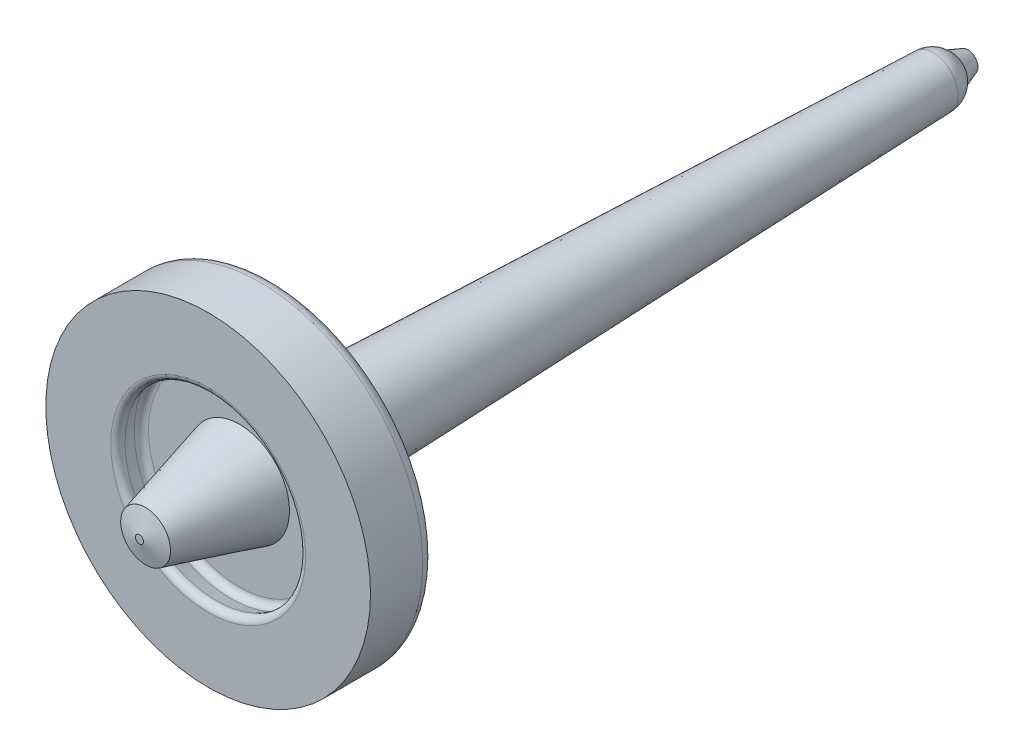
ISO-10303-21;
HEADER;
FILE_DESCRIPTION(('STEP AP214'),'2;1');
FILE_NAME('part.step','',(''),(''),'','','');
FILE_SCHEMA(('AUTOMOTIVE_DESIGN { 1 0 10303 214 1 1 1 1 }'));
ENDSEC;
DATA;
#1=APPLICATION_CONTEXT('core data for automotive mechanical design processes');
#2=APPLICATION_PROTOCOL_DEFINITION('international standard','automotive_design',2000,#1);
#3=PRODUCT_CONTEXT('',#1,'mechanical');
#4=PRODUCT('Part','Part','',(#3));
#5=PRODUCT_RELATED_PRODUCT_CATEGORY('part','',(#4));
#6=PRODUCT_DEFINITION_FORMATION('','',#4);
#7=PRODUCT_DEFINITION_CONTEXT('part definition',#1,'design');
#8=PRODUCT_DEFINITION('design','',#6,#7);
#9=PRODUCT_DEFINITION_SHAPE('','',#8);
#10=(LENGTH_UNIT() NAMED_UNIT(*) SI_UNIT(.MILLI.,.METRE.));
#11=(NAMED_UNIT(*) PLANE_ANGLE_UNIT() SI_UNIT($,.RADIAN.));
#12=(NAMED_UNIT(*) SI_UNIT($,.STERADIAN.) SOLID_ANGLE_UNIT());
#13=UNCERTAINTY_MEASURE_WITH_UNIT(LENGTH_MEASURE(1.E-05),#10,'distance_accuracy_value','');
#14=(GEOMETRIC_REPRESENTATION_CONTEXT(3) GLOBAL_UNCERTAINTY_ASSIGNED_CONTEXT((#13)) GLOBAL_UNIT_ASSIGNED_CONTEXT((#10,
#11,#12)) REPRESENTATION_CONTEXT('',''));
#15=CARTESIAN_POINT('',(0.,0.,0.));
#16=DIRECTION('',(0.,0.,1.));
#17=DIRECTION('',(1.,0.,0.));
#18=AXIS2_PLACEMENT_3D('',#15,#16,#17);
#19=CARTESIAN_POINT('',(0.,7.286,-136.666192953));
#20=DIRECTION('',(0.,0.,-1.));
#21=DIRECTION('',(-1.,0.,0.));
#22=AXIS2_PLACEMENT_3D('',#19,#20,#21);
#23=PLANE('',#22);
#24=CARTESIAN_POINT('',(0.,0.,-136.666192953));
#25=DIRECTION('',(0.,0.,1.));
#26=DIRECTION('',(0.,1.,0.));
#27=AXIS2_PLACEMENT_3D('',#24,#25,#26);
#28=CIRCLE('',#27,4.00989579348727);
#29=CARTESIAN_POINT('',(0.,4.01,-136.666484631));
#30=VERTEX_POINT('',#29);
#31=CARTESIAN_POINT('',(-4.01,0.,-136.666484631));
#32=VERTEX_POINT('',#31);
#33=EDGE_CURVE('E93',#30,#32,#28,.T.);
#34=ORIENTED_EDGE('',*,*,#33,.F.);
#35=CARTESIAN_POINT('',(0.,0.,-136.666192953));
#36=DIRECTION('',(0.,0.,1.));
#37=DIRECTION('',(0.479425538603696,0.87758256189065,0.));
#38=AXIS2_PLACEMENT_3D('',#35,#36,#37);
#39=CIRCLE('',#38,4.00989579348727);
#40=CARTESIAN_POINT('',(1.92249640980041,3.51910607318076,-136.666484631));
#41=VERTEX_POINT('',#40);
#42=EDGE_CURVE('E97',#41,#30,#39,.T.);
#43=ORIENTED_EDGE('',*,*,#42,.F.);
#44=CARTESIAN_POINT('',(0.,0.,-136.666192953));
#45=DIRECTION('',(0.,0.,1.));
#46=DIRECTION('',(1.,0.,0.));
#47=AXIS2_PLACEMENT_3D('',#44,#45,#46);
#48=CIRCLE('',#47,4.00989579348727);
#49=CARTESIAN_POINT('',(4.01,0.,-136.666484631));
#50=VERTEX_POINT('',#49);
#51=EDGE_CURVE('E108',#50,#41,#48,.T.);
#52=ORIENTED_EDGE('',*,*,#51,.F.);
#53=CARTESIAN_POINT('',(0.,0.,-136.666192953));
#54=DIRECTION('',(0.,0.,1.));
#55=DIRECTION('',(0.,-1.,0.));
#56=AXIS2_PLACEMENT_3D('',#53,#54,#55);
#57=CIRCLE('',#56,4.00989579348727);
#58=CARTESIAN_POINT('',(0.,-4.01,-136.666484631));
#59=VERTEX_POINT('',#58);
#60=EDGE_CURVE('E85',#59,#50,#57,.T.);
#61=ORIENTED_EDGE('',*,*,#60,.F.);
#62=CARTESIAN_POINT('',(0.,0.,-136.666192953));
#63=DIRECTION('',(0.,0.,1.));
#64=DIRECTION('',(-0.479425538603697,-0.877582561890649,0.));
#65=AXIS2_PLACEMENT_3D('',#62,#63,#64);
#66=CIRCLE('',#65,4.00989579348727);
#67=CARTESIAN_POINT('',(-1.92249640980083,-3.5191060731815,-136.666581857));
#68=VERTEX_POINT('',#67);
#69=EDGE_CURVE('E88',#68,#59,#66,.T.);
#70=ORIENTED_EDGE('',*,*,#69,.F.);
#71=CARTESIAN_POINT('',(0.,0.,-136.666192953));
#72=DIRECTION('',(0.,0.,1.));
#73=DIRECTION('',(-1.,0.,0.));
#74=AXIS2_PLACEMENT_3D('',#71,#72,#73);
#75=CIRCLE('',#74,4.00989579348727);
#76=EDGE_CURVE('E100',#32,#68,#75,.T.);
#77=ORIENTED_EDGE('',*,*,#76,.F.);
#78=EDGE_LOOP('',(#34,#43,#52,#61,#70,#77));
#79=FACE_BOUND('',#78,.T.);
#80=CARTESIAN_POINT('',(0.,0.,-136.666192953));
#81=DIRECTION('',(0.,0.,-1.));
#82=DIRECTION('',(-0.479425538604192,-0.877582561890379,0.));
#83=AXIS2_PLACEMENT_3D('',#80,#81,#82);
#84=CIRCLE('',#83,7.28599999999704);
#85=CARTESIAN_POINT('',(3.49309447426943,6.39406654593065,-136.666192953));
#86=VERTEX_POINT('',#85);
#87=CARTESIAN_POINT('',(-3.49309447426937,-6.39406654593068,-136.666192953));
#88=VERTEX_POINT('',#87);
#89=EDGE_CURVE('E165',#86,#88,#84,.F.);
#90=ORIENTED_EDGE('',*,*,#89,.T.);
#91=CARTESIAN_POINT('',(0.,0.,-136.666192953));
#92=DIRECTION('',(0.,0.,-1.));
#93=DIRECTION('',(0.479425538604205,0.877582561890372,0.));
#94=AXIS2_PLACEMENT_3D('',#91,#92,#93);
#95=CIRCLE('',#94,7.28599999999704);
#96=EDGE_CURVE('E176',#88,#86,#95,.F.);
#97=ORIENTED_EDGE('',*,*,#96,.T.);
#98=EDGE_LOOP('',(#90,#97));
#99=FACE_BOUND('',#98,.T.);
#100=ADVANCED_FACE('F30',(#79,#99),#23,.F.);
#101=CARTESIAN_POINT('',(0.,0.,-136.166192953));
#102=DIRECTION('',(0.,0.,-1.));
#103=DIRECTION('',(0.479425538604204,0.877582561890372,0.));
#104=AXIS2_PLACEMENT_3D('',#101,#102,#103);
#105=TOROIDAL_SURFACE('',#104,7.286,0.5);
#106=CARTESIAN_POINT('',(0.,0.,-135.995182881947));
#107=DIRECTION('',(0.,0.,-1.));
#108=DIRECTION('',(0.479425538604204,0.877582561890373,0.));
#109=AXIS2_PLACEMENT_3D('',#106,#107,#108);
#110=CIRCLE('',#109,7.7558463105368);
#111=CARTESIAN_POINT('',(3.71835079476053,6.80639547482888,-135.995182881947));
#112=VERTEX_POINT('',#111);
#113=EDGE_CURVE('E411',#112,#112,#110,.F.);
#114=ORIENTED_EDGE('',*,*,#113,.T.);
#115=EDGE_LOOP('',(#114));
#116=FACE_BOUND('',#115,.T.);
#117=ORIENTED_EDGE('',*,*,#89,.F.);
#118=ORIENTED_EDGE('',*,*,#96,.F.);
#119=EDGE_LOOP('',(#117,#118));
#120=FACE_BOUND('',#119,.T.);
#121=ADVANCED_FACE('F420',(#116,#120),#105,.F.);
#122=CARTESIAN_POINT('',(0.,0.,-135.995182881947));
#123=DIRECTION('',(0.,0.,-1.));
#124=DIRECTION('',(-1.,0.,0.));
#125=AXIS2_PLACEMENT_3D('',#122,#123,#124);
#126=CONICAL_SURFACE('',#125,7.75584631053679,0.349065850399);
#127=CARTESIAN_POINT('',(0.,0.,-134.836591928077));
#128=DIRECTION('',(0.,0.,-1.));
#129=DIRECTION('',(0.479425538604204,0.877582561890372,0.));
#130=AXIS2_PLACEMENT_3D('',#127,#128,#129);
#131=CIRCLE('',#130,7.33415368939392);
#132=CARTESIAN_POINT('',(3.51618058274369,6.43632538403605,-134.836591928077));
#133=VERTEX_POINT('',#132);
#134=EDGE_CURVE('E409',#133,#133,#131,.T.);
#135=ORIENTED_EDGE('',*,*,#134,.F.);
#136=EDGE_LOOP('',(#135));
#137=FACE_BOUND('',#136,.T.);
#138=ORIENTED_EDGE('',*,*,#113,.F.);
#139=EDGE_LOOP('',(#138));
#140=FACE_BOUND('',#139,.T.);
#141=ADVANCED_FACE('F390',(#137,#140),#126,.F.);
#142=CARTESIAN_POINT('',(0.,0.,-134.665581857));
#143=DIRECTION('',(0.,0.,-1.));
#144=DIRECTION('',(0.479425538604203,0.877582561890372,0.));
#145=AXIS2_PLACEMENT_3D('',#142,#143,#144);
#146=TOROIDAL_SURFACE('',#145,7.80400000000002,0.5);
#147=CARTESIAN_POINT('',(0.,0.,-134.165581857));
#148=DIRECTION('',(0.,0.,1.));
#149=DIRECTION('',(0.479425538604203,0.877582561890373,0.));
#150=AXIS2_PLACEMENT_3D('',#147,#148,#149);
#151=CIRCLE('',#150,7.80399999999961);
#152=CARTESIAN_POINT('',(3.74143690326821,6.84865431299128,-134.165581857));
#153=VERTEX_POINT('',#152);
#154=CARTESIAN_POINT('',(-3.74143690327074,-6.84865431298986,-134.165581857));
#155=VERTEX_POINT('',#154);
#156=EDGE_CURVE('E373',#153,#155,#151,.T.);
#157=ORIENTED_EDGE('',*,*,#156,.T.);
#158=CARTESIAN_POINT('',(0.,0.,-134.165581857));
#159=DIRECTION('',(0.,0.,1.));
#160=DIRECTION('',(-0.479425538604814,-0.877582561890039,0.));
#161=AXIS2_PLACEMENT_3D('',#158,#159,#160);
#162=CIRCLE('',#161,7.80399999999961);
#163=EDGE_CURVE('E344',#155,#153,#162,.T.);
#164=ORIENTED_EDGE('',*,*,#163,.T.);
#165=EDGE_LOOP('',(#157,#164));
#166=FACE_BOUND('',#165,.T.);
#167=ORIENTED_EDGE('',*,*,#134,.T.);
#168=EDGE_LOOP('',(#167));
#169=FACE_BOUND('',#168,.T.);
#170=ADVANCED_FACE('F379',(#166,#169),#146,.T.);
#171=CARTESIAN_POINT('',(0.,10.9995,-134.165581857));
#172=DIRECTION('',(0.,0.,-1.));
#173=DIRECTION('',(-1.,0.,0.));
#174=AXIS2_PLACEMENT_3D('',#171,#172,#173);
#175=PLANE('',#174);
#176=ORIENTED_EDGE('',*,*,#156,.F.);
#177=ORIENTED_EDGE('',*,*,#163,.F.);
#178=EDGE_LOOP('',(#176,#177));
#179=FACE_BOUND('',#178,.T.);
#180=CARTESIAN_POINT('',(0.,0.,-134.165581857));
#181=DIRECTION('',(0.,0.,1.));
#182=DIRECTION('',(1.,0.,0.));
#183=AXIS2_PLACEMENT_3D('',#180,#181,#182);
#184=CIRCLE('',#183,13.);
#185=CARTESIAN_POINT('',(13.,0.,-134.165581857));
#186=VERTEX_POINT('',#185);
#187=EDGE_CURVE('E342',#186,#186,#184,.F.);
#188=ORIENTED_EDGE('',*,*,#187,.F.);
#189=EDGE_LOOP('',(#188));
#190=FACE_BOUND('',#189,.T.);
#191=ADVANCED_FACE('F389',(#179,#190),#175,.F.);
#192=CARTESIAN_POINT('',(0.,0.,-136.755581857));
#193=DIRECTION('',(0.,0.,1.));
#194=DIRECTION('',(1.,0.,0.));
#195=AXIS2_PLACEMENT_3D('',#192,#193,#194);
#196=CYLINDRICAL_SURFACE('',#195,13.);
#197=ORIENTED_EDGE('',*,*,#187,.T.);
#198=EDGE_LOOP('',(#197));
#199=FACE_BOUND('',#198,.T.);
#200=CARTESIAN_POINT('',(0.,0.,-138.345581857));
#201=DIRECTION('',(0.,0.,1.));
#202=DIRECTION('',(-0.999999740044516,0.000721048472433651,0.));
#203=AXIS2_PLACEMENT_3D('',#200,#201,#202);
#204=CIRCLE('',#203,13.);
#205=CARTESIAN_POINT('',(-12.9999966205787,0.00937363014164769,-138.345581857));
#206=VERTEX_POINT('',#205);
#207=EDGE_CURVE('E256',#206,#206,#204,.F.);
#208=ORIENTED_EDGE('',*,*,#207,.F.);
#209=EDGE_LOOP('',(#208));
#210=FACE_BOUND('',#209,.T.);
#211=ADVANCED_FACE('F270',(#199,#210),#196,.T.);
#212=CARTESIAN_POINT('',(0.,0.,-138.345581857));
#213=DIRECTION('',(0.,0.,1.));
#214=DIRECTION('',(-0.999999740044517,0.000721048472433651,0.));
#215=AXIS2_PLACEMENT_3D('',#212,#213,#214);
#216=TOROIDAL_SURFACE('',#215,12.,1.);
#217=ORIENTED_EDGE('',*,*,#207,.T.);
#218=EDGE_LOOP('',(#217));
#219=FACE_BOUND('',#218,.T.);
#220=CARTESIAN_POINT('',(0.,0.,-139.345581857));
#221=DIRECTION('',(0.,0.,1.));
#222=DIRECTION('',(-0.999999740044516,0.000721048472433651,0.));
#223=AXIS2_PLACEMENT_3D('',#220,#221,#222);
#224=CIRCLE('',#223,11.9999999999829);
#225=CARTESIAN_POINT('',(-11.9999968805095,0.00865258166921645,-139.345581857));
#226=VERTEX_POINT('',#225);
#227=CARTESIAN_POINT('',(11.9999968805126,-0.00865257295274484,-139.345581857));
#228=VERTEX_POINT('',#227);
#229=EDGE_CURVE('E250',#226,#228,#224,.T.);
#230=ORIENTED_EDGE('',*,*,#229,.T.);
#231=CARTESIAN_POINT('',(11.9999968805,-0.0086525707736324,-139.345581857));
#232=CARTESIAN_POINT('',(12.0001426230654,0.187697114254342,-139.345581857));
#233=CARTESIAN_POINT('',(11.9954610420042,0.384049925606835,-139.345581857));
#234=CARTESIAN_POINT('',(11.9764727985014,0.776289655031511,-139.345581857));
#235=CARTESIAN_POINT('',(11.9621661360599,0.972176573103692,-139.345581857));
#236=CARTESIAN_POINT('',(11.9239572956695,1.36301237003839,-139.345581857));
#237=CARTESIAN_POINT('',(11.9000551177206,1.55796124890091,-139.345581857));
#238=CARTESIAN_POINT('',(11.8427141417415,1.94645138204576,-139.345581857));
#239=CARTESIAN_POINT('',(11.8092753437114,2.13999263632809,-139.345581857));
#240=CARTESIAN_POINT('',(11.7329413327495,2.52520124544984,-139.345581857));
#241=CARTESIAN_POINT('',(11.6900461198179,2.71686860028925,-139.345581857));
#242=CARTESIAN_POINT('',(11.5949027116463,3.09786767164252,-139.345581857));
#243=CARTESIAN_POINT('',(11.5426545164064,3.28719938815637,-139.345581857));
#244=CARTESIAN_POINT('',(11.4289309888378,3.66307106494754,-139.345581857));
#245=CARTESIAN_POINT('',(11.3674556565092,3.84961102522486,-139.345581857));
#246=CARTESIAN_POINT('',(11.2354259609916,4.21944979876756,-139.345581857));
#247=CARTESIAN_POINT('',(11.1648715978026,4.40274861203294,-139.345581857));
#248=CARTESIAN_POINT('',(11.0148538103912,4.765663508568,-139.345581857));
#249=CARTESIAN_POINT('',(10.9353903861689,4.94527959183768,-139.345581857));
#250=CARTESIAN_POINT('',(10.7677459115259,5.30039631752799,-139.345581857));
#251=CARTESIAN_POINT('',(10.6795648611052,5.47589695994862,-139.345581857));
#252=CARTESIAN_POINT('',(10.4946975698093,5.82236000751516,-139.345581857));
#253=CARTESIAN_POINT('',(10.3980113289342,5.99332241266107,-139.345581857));
#254=CARTESIAN_POINT('',(10.1963665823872,6.33029712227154,-139.345581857));
#255=CARTESIAN_POINT('',(10.0914080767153,6.49630942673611,-139.345581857));
#256=CARTESIAN_POINT('',(9.87347165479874,6.82298399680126,-139.345581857));
#257=CARTESIAN_POINT('',(9.76049373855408,6.98364626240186,-139.345581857));
#258=CARTESIAN_POINT('',(9.52679066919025,7.29923370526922,-139.345581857));
#259=CARTESIAN_POINT('',(9.40606551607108,7.454158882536,-139.345581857));
#260=CARTESIAN_POINT('',(9.15715881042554,7.75789892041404,-139.345581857));
#261=CARTESIAN_POINT('',(9.02897725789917,7.90671378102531,-139.345581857));
#262=CARTESIAN_POINT('',(8.76546655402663,8.19787467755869,-139.345581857));
#263=CARTESIAN_POINT('',(8.63013740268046,8.3402207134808,-139.345581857));
#264=CARTESIAN_POINT('',(8.35265752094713,8.6181010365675,-139.345581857));
#265=CARTESIAN_POINT('',(8.21050679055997,8.75363532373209,-139.345581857));
#266=CARTESIAN_POINT('',(7.91972620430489,9.01756563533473,-139.345581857));
#267=CARTESIAN_POINT('',(7.77109634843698,9.1459616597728,-139.345581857));
#268=CARTESIAN_POINT('',(7.46771557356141,9.39530612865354,-139.345581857));
#269=CARTESIAN_POINT('',(7.31296465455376,9.51625457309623,-139.345581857));
#270=CARTESIAN_POINT('',(6.99771456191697,9.75041250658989,-139.345581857));
#271=CARTESIAN_POINT('',(6.83721538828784,9.86362199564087,-139.345581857));
#272=CARTESIAN_POINT('',(6.5108554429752,10.0820292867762,-139.345581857));
#273=CARTESIAN_POINT('',(6.3449946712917,10.1872270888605,-139.345581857));
#274=CARTESIAN_POINT('',(6.00831110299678,10.3893575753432,-139.345581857));
#275=CARTESIAN_POINT('',(5.83748830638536,10.4862902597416,-139.345581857));
#276=CARTESIAN_POINT('',(5.4912922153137,10.6716569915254,-139.345581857));
#277=CARTESIAN_POINT('',(5.31591892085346,10.7600910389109,-139.345581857));
#278=CARTESIAN_POINT('',(4.96104432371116,10.9282474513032,-139.345581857));
#279=CARTESIAN_POINT('',(4.7815430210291,11.0079698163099,-139.345581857));
#280=CARTESIAN_POINT('',(4.41884484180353,11.1585108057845,-139.345581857));
#281=CARTESIAN_POINT('',(4.23564796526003,11.2293294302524,-139.345581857));
#282=CARTESIAN_POINT('',(3.86599997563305,11.3618923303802,-139.345581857));
#283=CARTESIAN_POINT('',(3.67954886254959,11.42363660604,-139.345581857));
#284=CARTESIAN_POINT('',(3.30384157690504,11.5379020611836,-139.345581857));
#285=CARTESIAN_POINT('',(3.11458540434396,11.5904232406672,-139.345581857));
#286=CARTESIAN_POINT('',(2.73372393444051,11.6861159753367,-139.345581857));
#287=CARTESIAN_POINT('',(2.54211863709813,11.7292875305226,-139.345581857));
#288=CARTESIAN_POINT('',(2.15702051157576,11.8061770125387,-139.345581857));
#289=CARTESIAN_POINT('',(1.96352768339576,11.839894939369,-139.345581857));
#290=CARTESIAN_POINT('',(1.57512063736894,11.8977959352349,-139.345581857));
#291=CARTESIAN_POINT('',(1.38020641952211,11.9219790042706,-139.345581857));
#292=CARTESIAN_POINT('',(0.989426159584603,11.9607520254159,-139.345581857));
#293=CARTESIAN_POINT('',(0.793560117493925,11.9753419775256,-139.345581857));
#294=CARTESIAN_POINT('',(0.40134806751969,11.9948936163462,-139.345581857));
#295=CARTESIAN_POINT('',(0.205002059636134,11.9998553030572,-139.345581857));
#296=CARTESIAN_POINT('',(-0.187696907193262,12.0001384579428,-139.345581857));
#297=CARTESIAN_POINT('',(-0.384049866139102,11.9954599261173,-139.345581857));
#298=CARTESIAN_POINT('',(-0.776289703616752,11.9764739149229,-139.345581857));
#299=CARTESIAN_POINT('',(-0.972176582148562,11.962166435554,-139.345581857));
#300=CARTESIAN_POINT('',(-1.36301235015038,11.9239569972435,-139.345581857));
#301=CARTESIAN_POINT('',(-1.55796123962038,11.9000550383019,-139.345581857));
#302=CARTESIAN_POINT('',(-1.94645138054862,11.8427142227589,-139.345581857));
#303=CARTESIAN_POINT('',(-2.13999263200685,11.8092753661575,-139.345581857));
#304=CARTESIAN_POINT('',(-2.52520123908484,11.732941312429,-139.345581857));
#305=CARTESIAN_POINT('',(-2.71686859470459,11.690046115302,-139.345581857));
#306=CARTESIAN_POINT('',(-3.09786766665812,11.5949027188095,-139.345581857));
#307=CARTESIAN_POINT('',(-3.28719938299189,11.542654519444,-139.345581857));
#308=CARTESIAN_POINT('',(-3.66307105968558,11.428930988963,-139.345581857));
#309=CARTESIAN_POINT('',(-3.84961102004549,11.3674556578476,-139.345581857));
#310=CARTESIAN_POINT('',(-4.21944979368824,11.2354259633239,-139.345581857));
#311=CARTESIAN_POINT('',(-4.40274860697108,11.1648715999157,-139.345581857));
#312=CARTESIAN_POINT('',(-4.76566350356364,11.0148538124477,-139.345581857));
#313=CARTESIAN_POINT('',(-4.94527958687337,10.9353903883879,-139.345581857));
#314=CARTESIAN_POINT('',(-5.30039631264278,10.7677459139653,-139.345581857));
#315=CARTESIAN_POINT('',(-5.47589695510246,10.6795648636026,-139.345581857));
#316=CARTESIAN_POINT('',(-5.82236000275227,10.4946975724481,-139.345581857));
#317=CARTESIAN_POINT('',(-5.99332240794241,10.3980113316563,-139.345581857));
#318=CARTESIAN_POINT('',(-6.33029711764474,10.1963665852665,-139.345581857));
#319=CARTESIAN_POINT('',(-6.49630942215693,10.0914080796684,-139.345581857));
#320=CARTESIAN_POINT('',(-6.82298399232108,9.87347165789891,-139.345581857));
#321=CARTESIAN_POINT('',(-6.98364625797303,9.76049374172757,-139.345581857));
#322=CARTESIAN_POINT('',(-7.29923370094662,9.52679067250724,-139.345581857));
#323=CARTESIAN_POINT('',(-7.45415887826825,9.40606551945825,-139.345581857));
#324=CARTESIAN_POINT('',(-7.75789891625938,9.15715881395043,-139.345581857));
#325=CARTESIAN_POINT('',(-7.90671377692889,9.02897726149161,-139.345581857));
#326=CARTESIAN_POINT('',(-8.197874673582,8.76546655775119,-139.345581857));
#327=CARTESIAN_POINT('',(-8.3402207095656,8.6301374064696,-139.345581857));
#328=CARTESIAN_POINT('',(-8.61810103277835,8.35265752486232,-139.345581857));
#329=CARTESIAN_POINT('',(-8.75363532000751,8.21050679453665,-139.345581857));
#330=CARTESIAN_POINT('',(-9.01756563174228,7.91972620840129,-139.345581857));
#331=CARTESIAN_POINT('',(-9.14596165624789,7.77109635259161,-139.345581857));
#332=CARTESIAN_POINT('',(-9.39530612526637,7.46771557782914,-139.345581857));
#333=CARTESIAN_POINT('',(-9.51625456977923,7.31296465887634,-139.345581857));
#334=CARTESIAN_POINT('',(-9.75041250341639,6.99771456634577,-139.345581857));
#335=CARTESIAN_POINT('',(-9.86362199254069,6.837215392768,-139.345581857));
#336=CARTESIAN_POINT('',(-10.0820292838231,6.51085544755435,-139.345581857));
#337=CARTESIAN_POINT('',(-10.1872270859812,6.34499467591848,-139.345581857));
#338=CARTESIAN_POINT('',(-10.389357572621,6.00831110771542,-139.345581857));
#339=CARTESIAN_POINT('',(-10.4862902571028,5.83748831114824,-139.345581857));
#340=CARTESIAN_POINT('',(-10.671656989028,5.49129222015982,-139.345581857));
#341=CARTESIAN_POINT('',(-10.7600910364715,5.31591892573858,-139.345581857));
#342=CARTESIAN_POINT('',(-10.9282474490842,4.96104432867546,-139.345581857));
#343=CARTESIAN_POINT('',(-11.0079698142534,4.78154302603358,-139.345581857));
#344=CARTESIAN_POINT('',(-11.1585108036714,4.41884484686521,-139.345581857));
#345=CARTESIAN_POINT('',(-11.2293294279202,4.23564797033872,-139.345581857));
#346=CARTESIAN_POINT('',(-11.3618923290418,3.86599998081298,-139.345581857));
#347=CARTESIAN_POINT('',(-11.4236366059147,3.67954886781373,-139.345581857));
#348=CARTESIAN_POINT('',(-11.537902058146,3.30384158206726,-139.345581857));
#349=CARTESIAN_POINT('',(-11.5904232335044,3.11458540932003,-139.345581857));
#350=CARTESIAN_POINT('',(-11.6861159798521,2.73372394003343,-139.345581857));
#351=CARTESIAN_POINT('',(-11.7292875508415,2.54211864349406,-139.345581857));
#352=CARTESIAN_POINT('',(-11.8061769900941,2.157020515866,-139.345581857));
#353=CARTESIAN_POINT('',(-11.8398948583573,1.96352768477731,-139.345581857));
#354=CARTESIAN_POINT('',(-11.897796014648,1.57512064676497,-139.345581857));
#355=CARTESIAN_POINT('',(-11.9219793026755,1.38020643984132,-139.345581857));
#356=CARTESIAN_POINT('',(-11.9607517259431,0.989426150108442,-139.345581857));
#357=CARTESIAN_POINT('',(-11.9753408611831,0.793560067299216,-139.345581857));
#358=CARTESIAN_POINT('',(-11.994894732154,0.401348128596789,-139.345581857));
#359=CARTESIAN_POINT('',(-11.9998594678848,0.205002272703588,-139.345581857));
#360=CARTESIAN_POINT('',(-11.9999968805,0.00865258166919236,-139.345581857));
#361=B_SPLINE_CURVE_WITH_KNOTS('',3,(#231,#232,#233,#234,#235,#236,#237,#238,#239,#240,#241,
#242,#243,#244,#245,#246,#247,#248,#249,#250,#251,#252,#253,#254,#255,#256,#257,#258,#259,#260,
#261,#262,#263,#264,#265,#266,#267,#268,#269,#270,#271,#272,#273,#274,#275,#276,#277,#278,#279,
#280,#281,#282,#283,#284,#285,#286,#287,#288,#289,#290,#291,#292,#293,#294,#295,#296,#297,#298,
#299,#300,#301,#302,#303,#304,#305,#306,#307,#308,#309,#310,#311,#312,#313,#314,#315,#316,#317,
#318,#319,#320,#321,#322,#323,#324,#325,#326,#327,#328,#329,#330,#331,#332,#333,#334,#335,#336,
#337,#338,#339,#340,#341,#342,#343,#344,#345,#346,#347,#348,#349,#350,#351,#352,#353,#354,#355,
#356,#357,#358,#359,#360),.UNSPECIFIED.,.F.,.F.,(4,2,2,2,2,2,2,2,2,2,2,2,2,2,2,2,2,2,2,2,2,2,2,
2,2,2,2,2,2,2,2,2,2,2,2,2,2,2,2,2,2,2,2,2,2,2,2,2,2,2,2,2,2,2,2,2,2,2,2,2,2,2,2,2,4),(0.,
0.588989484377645,1.17797896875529,1.76696845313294,2.3559579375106,2.94494742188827,
3.53393690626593,4.12292639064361,4.7119158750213,5.30090535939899,5.88989484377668,
6.47888432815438,7.06787381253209,7.65686329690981,8.24585278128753,8.83484226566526,
9.42383175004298,10.0128212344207,10.6018107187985,11.1908002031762,11.779789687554,
12.3687791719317,12.9577686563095,13.5467581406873,14.1357476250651,14.7247371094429,
15.3137265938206,15.9027160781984,16.4917055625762,17.0806950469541,17.6696845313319,
18.2586740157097,18.8476635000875,19.4366529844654,20.0256424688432,20.614631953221,
21.2036214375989,21.7926109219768,22.3816004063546,22.9705898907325,23.5595793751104,
24.1485688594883,24.7375583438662,25.326547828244,25.9155373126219,26.5045267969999,
27.0935162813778,27.6825057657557,28.2714952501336,28.8604847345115,29.4494742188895,
30.0384637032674,30.6274531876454,31.2164426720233,31.8054321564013,32.3944216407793,
32.9834111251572,33.5724006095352,34.1613900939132,34.7503795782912,35.3393690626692,
35.9283585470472,36.5173480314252,37.1063375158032,37.6953270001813),.UNSPECIFIED.);
#362=EDGE_CURVE('E283',#228,#226,#361,.T.);
#363=ORIENTED_EDGE('',*,*,#362,.T.);
#364=EDGE_LOOP('',(#230,#363));
#365=FACE_BOUND('',#364,.T.);
#366=ADVANCED_FACE('F258',(#219,#365),#216,.T.);
#367=CARTESIAN_POINT('',(0.,0.,-195.));
#368=DIRECTION('',(0.,0.,-1.));
#369=DIRECTION('',(-1.,0.,0.));
#370=AXIS2_PLACEMENT_3D('',#367,#368,#369);
#371=PLANE('',#370);
#372=CARTESIAN_POINT('',(0.,0.,-195.00000000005));
#373=DIRECTION('',(0.,0.,1.));
#374=DIRECTION('',(1.,0.,0.));
#375=AXIS2_PLACEMENT_3D('',#372,#373,#374);
#376=CIRCLE('',#375,0.807273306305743);
#377=CARTESIAN_POINT('',(0.807273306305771,0.,-195.00000000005));
#378=VERTEX_POINT('',#377);
#379=EDGE_CURVE('E339',#378,#378,#376,.T.);
#380=ORIENTED_EDGE('',*,*,#379,.F.);
#381=EDGE_LOOP('',(#380));
#382=FACE_BOUND('',#381,.T.);
#383=ADVANCED_FACE('F269',(#382),#371,.T.);
#384=CARTESIAN_POINT('',(0.,0.,-139.345581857));
#385=DIRECTION('',(0.,0.,1.));
#386=DIRECTION('',(1.,0.,0.));
#387=AXIS2_PLACEMENT_3D('',#384,#385,#386);
#388=PLANE('',#387);
#389=CARTESIAN_POINT('',(0.,0.,-139.345581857));
#390=DIRECTION('',(0.,0.,1.));
#391=DIRECTION('',(0.,-1.,0.));
#392=AXIS2_PLACEMENT_3D('',#389,#390,#391);
#393=CIRCLE('',#392,5.49216853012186);
#394=CARTESIAN_POINT('',(0.,-5.49216853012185,-139.345581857));
#395=VERTEX_POINT('',#394);
#396=EDGE_CURVE('E333',#395,#395,#393,.T.);
#397=ORIENTED_EDGE('',*,*,#396,.T.);
#398=EDGE_LOOP('',(#397));
#399=FACE_BOUND('',#398,.T.);
#400=ORIENTED_EDGE('',*,*,#362,.F.);
#401=ORIENTED_EDGE('',*,*,#229,.F.);
#402=EDGE_LOOP('',(#400,#401));
#403=FACE_BOUND('',#402,.T.);
#404=ADVANCED_FACE('F288',(#399,#403),#388,.F.);
#405=CARTESIAN_POINT('',(0.,0.,-193.686778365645));
#406=DIRECTION('',(0.,0.,1.));
#407=DIRECTION('',(1.,0.,0.));
#408=AXIS2_PLACEMENT_3D('',#405,#406,#407);
#409=CONICAL_SURFACE('',#408,1.28400138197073,0.348228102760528);
#410=CARTESIAN_POINT('',(1.12725376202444,0.614760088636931,-193.686808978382));
#411=CARTESIAN_POINT('',(1.08820596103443,0.686341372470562,-193.686808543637));
#412=CARTESIAN_POINT('',(1.04224092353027,0.75433395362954,-193.686808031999));
#413=CARTESIAN_POINT('',(0.938139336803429,0.880482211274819,-193.686806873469));
#414=CARTESIAN_POINT('',(0.879968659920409,0.938609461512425,-193.686806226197));
#415=CARTESIAN_POINT('',(0.761081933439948,1.03663281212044,-193.686804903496));
#416=CARTESIAN_POINT('',(0.701465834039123,1.0778679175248,-193.686804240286));
#417=CARTESIAN_POINT('',(0.576214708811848,1.14970402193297,-193.686802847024));
#418=CARTESIAN_POINT('',(0.510586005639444,1.18031603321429,-193.686802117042));
#419=CARTESIAN_POINT('',(0.375095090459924,1.23010331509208,-193.686800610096));
#420=CARTESIAN_POINT('',(0.305231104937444,1.24927375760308,-193.686799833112));
#421=CARTESIAN_POINT('',(0.163262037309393,1.27561738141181,-193.686798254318));
#422=CARTESIAN_POINT('',(0.0911565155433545,1.28278819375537,-193.686797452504));
#423=CARTESIAN_POINT('',(-0.0532285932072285,1.28492119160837,-193.686795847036));
#424=CARTESIAN_POINT('',(-0.125508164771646,1.27988442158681,-193.686795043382));
#425=CARTESIAN_POINT('',(-0.268193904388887,1.25774786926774,-193.686793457));
#426=CARTESIAN_POINT('',(-0.338600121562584,1.24064840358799,-193.686792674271));
#427=CARTESIAN_POINT('',(-0.475543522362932,1.19487162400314,-193.686791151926));
#428=CARTESIAN_POINT('',(-0.542080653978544,1.16619415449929,-193.686790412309));
#429=CARTESIAN_POINT('',(-0.669395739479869,1.09807633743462,-193.6867889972));
#430=CARTESIAN_POINT('',(-0.730173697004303,1.05863599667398,-193.686788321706));
#431=CARTESIAN_POINT('',(-0.844245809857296,0.970109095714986,-193.68678705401));
#432=CARTESIAN_POINT('',(-0.897540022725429,0.921022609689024,-193.686786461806));
#433=CARTESIAN_POINT('',(-0.995129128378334,0.814607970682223,-193.686785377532));
#434=CARTESIAN_POINT('',(-1.03942387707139,0.757279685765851,-193.686784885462));
#435=CARTESIAN_POINT('',(-1.11777237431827,0.635961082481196,-193.686784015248));
#436=CARTESIAN_POINT('',(-1.15182564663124,0.57197045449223,-193.68678363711));
#437=CARTESIAN_POINT('',(-1.19445992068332,0.472469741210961,-193.686783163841));
#438=CARTESIAN_POINT('',(-1.20726501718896,0.438711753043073,-193.686783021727));
#439=CARTESIAN_POINT('',(-1.23000293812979,0.370204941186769,-193.686782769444));
#440=CARTESIAN_POINT('',(-1.23993297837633,0.335455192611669,-193.686782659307));
#441=CARTESIAN_POINT('',(-1.26525630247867,0.230177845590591,-193.686782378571));
#442=CARTESIAN_POINT('',(-1.27622004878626,0.158534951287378,-193.686782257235));
#443=CARTESIAN_POINT('',(-1.2859484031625,0.0144295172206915,-193.686782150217));
#444=CARTESIAN_POINT('',(-1.28471349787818,-0.0580329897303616,-193.686782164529));
#445=CARTESIAN_POINT('',(-1.27376476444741,-0.165801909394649,-193.686782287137));
#446=CARTESIAN_POINT('',(-1.26858659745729,-0.201616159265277,-193.686782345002));
#447=CARTESIAN_POINT('',(-1.25523937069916,-0.27264701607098,-193.686782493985));
#448=CARTESIAN_POINT('',(-1.2470727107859,-0.307864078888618,-193.686782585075));
#449=CARTESIAN_POINT('',(-1.21817840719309,-0.412158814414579,-193.686782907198));
#450=CARTESIAN_POINT('',(-1.19303398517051,-0.480099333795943,-193.686783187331));
#451=CARTESIAN_POINT('',(-1.15141844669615,-0.56883345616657,-193.686783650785));
#452=CARTESIAN_POINT('',(-1.13968865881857,-0.591984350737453,-193.6867837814));
#453=CARTESIAN_POINT('',(-1.08820904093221,-0.686352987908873,-193.686784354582));
#454=CARTESIAN_POINT('',(-1.04224291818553,-0.754345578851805,-193.686784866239));
#455=CARTESIAN_POINT('',(-0.938139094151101,-0.880493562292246,-193.686786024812));
#456=CARTESIAN_POINT('',(-0.879967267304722,-0.938620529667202,-193.686786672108));
#457=CARTESIAN_POINT('',(-0.761078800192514,-1.03664271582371,-193.686787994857));
#458=CARTESIAN_POINT('',(-0.701462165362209,-1.07787704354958,-193.686788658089));
#459=CARTESIAN_POINT('',(-0.576210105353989,-1.14971151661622,-193.686790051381));
#460=CARTESIAN_POINT('',(-0.510581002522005,-1.1803226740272,-193.686790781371));
#461=CARTESIAN_POINT('',(-0.375089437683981,-1.23010819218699,-193.686792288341));
#462=CARTESIAN_POINT('',(-0.305225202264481,-1.24927772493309,-193.686793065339));
#463=CARTESIAN_POINT('',(-0.163255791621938,-1.27561949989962,-193.686794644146));
#464=CARTESIAN_POINT('',(-0.0911501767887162,-1.28278937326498,-193.686795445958));
#465=CARTESIAN_POINT('',(0.0532349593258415,-1.28492049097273,-193.686797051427));
#466=CARTESIAN_POINT('',(0.125514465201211,-1.27988277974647,-193.686797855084));
#467=CARTESIAN_POINT('',(0.268199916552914,-1.25774436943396,-193.686799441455));
#468=CARTESIAN_POINT('',(0.338605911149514,-1.24064398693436,-193.68680022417));
#469=CARTESIAN_POINT('',(0.475548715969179,-1.19486542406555,-193.686801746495));
#470=CARTESIAN_POINT('',(0.542085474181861,-1.16618708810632,-193.686802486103));
#471=CARTESIAN_POINT('',(0.669399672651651,-1.0980676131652,-193.686803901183));
#472=CARTESIAN_POINT('',(0.73017711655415,-1.05862648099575,-193.686804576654));
#473=CARTESIAN_POINT('',(0.844248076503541,-0.97009809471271,-193.686805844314));
#474=CARTESIAN_POINT('',(0.897541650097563,-0.921010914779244,-193.686806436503));
#475=CARTESIAN_POINT('',(0.995129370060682,-0.814595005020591,-193.686807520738));
#476=CARTESIAN_POINT('',(1.03942337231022,-0.757266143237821,-193.686808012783));
#477=CARTESIAN_POINT('',(1.11777029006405,-0.635946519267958,-193.686808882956));
#478=CARTESIAN_POINT('',(1.15182272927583,-0.571955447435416,-193.686809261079));
#479=CARTESIAN_POINT('',(1.19445570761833,-0.472454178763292,-193.686809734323));
#480=CARTESIAN_POINT('',(1.20726036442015,-0.438696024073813,-193.686809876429));
#481=CARTESIAN_POINT('',(1.22999739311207,-0.370188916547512,-193.686810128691));
#482=CARTESIAN_POINT('',(1.23992698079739,-0.335439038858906,-193.686810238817));
#483=CARTESIAN_POINT('',(1.26524893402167,-0.23016136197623,-193.686810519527));
#484=CARTESIAN_POINT('',(1.27621174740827,-0.15851832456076,-193.686810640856));
#485=CARTESIAN_POINT('',(1.28593822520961,-0.0144127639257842,-193.68681074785));
#486=CARTESIAN_POINT('',(1.28470237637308,0.0580497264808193,-193.686810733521));
#487=CARTESIAN_POINT('',(1.27375223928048,0.16581850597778,-193.686810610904));
#488=CARTESIAN_POINT('',(1.26857360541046,0.201632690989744,-193.686810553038));
#489=CARTESIAN_POINT('',(1.25522545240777,0.272663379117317,-193.686810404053));
#490=CARTESIAN_POINT('',(1.24705833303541,0.307880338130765,-193.686810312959));
#491=CARTESIAN_POINT('',(1.21816266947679,0.412174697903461,-193.686809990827));
#492=CARTESIAN_POINT('',(1.1930173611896,0.480114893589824,-193.686809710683));
#493=CARTESIAN_POINT('',(1.15140489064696,0.568839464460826,-193.686809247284));
#494=CARTESIAN_POINT('',(1.13967956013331,0.59198147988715,-193.686809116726));
#495=CARTESIAN_POINT('',(1.12725376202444,0.614760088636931,-193.686808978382));
#496=B_SPLINE_CURVE_WITH_KNOTS('',3,(#410,#411,#412,#413,#414,#415,#416,#417,#418,#419,#420,
#421,#422,#423,#424,#425,#426,#427,#428,#429,#430,#431,#432,#433,#434,#435,#436,#437,#438,#439,
#440,#441,#442,#443,#444,#445,#446,#447,#448,#449,#450,#451,#452,#453,#454,#455,#456,#457,#458,
#459,#460,#461,#462,#463,#464,#465,#466,#467,#468,#469,#470,#471,#472,#473,#474,#475,#476,#477,
#478,#479,#480,#481,#482,#483,#484,#485,#486,#487,#488,#489,#490,#491,#492,#493,#494,#495),
.UNSPECIFIED.,.T.,.F.,(4,2,2,2,2,2,2,2,2,2,2,2,2,2,2,2,2,2,2,2,2,2,2,2,2,2,2,2,2,2,2,2,2,2,2,2,
2,2,2,2,2,2,4),(0.,0.244532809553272,0.489758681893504,0.70620455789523,0.922425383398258,
1.13873738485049,1.35509208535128,1.57142827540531,1.78775878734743,2.00409220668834,
2.22042548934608,2.43675710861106,2.65309219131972,2.86943733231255,2.97764213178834,
3.08595136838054,3.302289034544,3.51861807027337,3.62706160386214,3.73541824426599,
3.95147800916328,4.02932305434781,4.27385770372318,4.5190853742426,4.73553124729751,
4.95175207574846,5.16806407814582,5.38441877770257,5.60075496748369,5.8170854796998,
6.03341889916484,6.24975218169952,6.46608380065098,6.68241888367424,6.89876402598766,
7.00696882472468,7.11527806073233,7.33161572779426,7.54794476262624,7.65638830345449,
7.76474495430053,7.98080470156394,8.05861997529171),.UNSPECIFIED.);
#497=CARTESIAN_POINT('',(1.12725376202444,0.614760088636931,-193.686808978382));
#498=VERTEX_POINT('',#497);
#499=EDGE_CURVE('E241',#498,#498,#496,.T.);
#500=ORIENTED_EDGE('',*,*,#499,.F.);
#501=EDGE_LOOP('',(#500));
#502=FACE_BOUND('',#501,.T.);
#503=ORIENTED_EDGE('',*,*,#379,.T.);
#504=EDGE_LOOP('',(#503));
#505=FACE_BOUND('',#504,.T.);
#506=ADVANCED_FACE('F297',(#502,#505),#409,.T.);
#507=CARTESIAN_POINT('',(0.,0.,-141.324030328));
#508=DIRECTION('',(0.,0.,1.));
#509=DIRECTION('',(-0.877928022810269,-0.478792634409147,0.));
#510=AXIS2_PLACEMENT_3D('',#507,#508,#509);
#511=TOROIDAL_SURFACE('',#510,5.78498527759,2.);
#512=CARTESIAN_POINT('',(0.,0.,-141.253934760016));
#513=DIRECTION('',(0.,0.,1.));
#514=DIRECTION('',(-0.877928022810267,-0.478792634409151,0.));
#515=AXIS2_PLACEMENT_3D('',#512,#513,#514);
#516=CIRCLE('',#515,3.78621400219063);
#517=CARTESIAN_POINT('',(-3.32402337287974,-1.81281137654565,-141.253934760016));
#518=VERTEX_POINT('',#517);
#519=EDGE_CURVE('E41',#518,#518,#516,.F.);
#520=ORIENTED_EDGE('',*,*,#519,.F.);
#521=EDGE_LOOP('',(#520));
#522=FACE_BOUND('',#521,.T.);
#523=ORIENTED_EDGE('',*,*,#396,.F.);
#524=EDGE_LOOP('',(#523));
#525=FACE_BOUND('',#524,.T.);
#526=ADVANCED_FACE('F233',(#522,#525),#511,.F.);
#527=CARTESIAN_POINT('',(1.18675055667E-05,-8.55703480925E-09,-192.153382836));
#528=DIRECTION('',(-0.877928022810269,-0.478792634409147,0.));
#529=DIRECTION('',(0.478792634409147,-0.877928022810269,0.));
#530=AXIS2_PLACEMENT_3D('',#527,#528,#529);
#531=SPHERICAL_SURFACE('',#530,2.);
#532=ORIENTED_EDGE('',*,*,#499,.T.);
#533=EDGE_LOOP('',(#532));
#534=FACE_BOUND('',#533,.T.);
#535=CARTESIAN_POINT('',(-1.75497939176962,-0.957107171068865,-192.216244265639));
#536=CARTESIAN_POINT('',(-1.76920419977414,-0.931020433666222,-192.216322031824));
#537=CARTESIAN_POINT('',(-1.78285088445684,-0.904614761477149,-192.216283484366));
#538=CARTESIAN_POINT('',(-1.8091839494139,-0.850751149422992,-192.216204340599));
#539=CARTESIAN_POINT('',(-1.82184917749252,-0.823282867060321,-192.216163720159));
#540=CARTESIAN_POINT('',(-1.84036675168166,-0.780586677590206,-192.216287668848));
#541=CARTESIAN_POINT('',(-1.84666892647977,-0.765551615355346,-192.216366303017));
#542=CARTESIAN_POINT('',(-1.86992814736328,-0.708113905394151,-192.216497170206));
#543=CARTESIAN_POINT('',(-1.88563194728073,-0.665192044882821,-192.216246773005));
#544=CARTESIAN_POINT('',(-1.91020136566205,-0.590122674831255,-192.216242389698));
#545=CARTESIAN_POINT('',(-1.9197676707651,-0.558201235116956,-192.21637244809));
#546=CARTESIAN_POINT('',(-1.9338788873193,-0.506457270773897,-192.216474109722));
#547=CARTESIAN_POINT('',(-1.93892713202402,-0.486771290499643,-192.216487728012));
#548=CARTESIAN_POINT('',(-1.94899279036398,-0.444878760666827,-192.21648529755));
#549=CARTESIAN_POINT('',(-1.95393352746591,-0.422653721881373,-192.216465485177));
#550=CARTESIAN_POINT('',(-1.96354276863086,-0.375655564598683,-192.216402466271));
#551=CARTESIAN_POINT('',(-1.96812521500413,-0.350864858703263,-192.216356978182));
#552=CARTESIAN_POINT('',(-1.9767469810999,-0.298718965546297,-192.216277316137));
#553=CARTESIAN_POINT('',(-1.98069077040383,-0.271347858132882,-192.216244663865));
#554=CARTESIAN_POINT('',(-1.98595101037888,-0.228558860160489,-192.216243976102));
#555=CARTESIAN_POINT('',(-1.98765945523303,-0.213188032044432,-192.216253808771));
#556=CARTESIAN_POINT('',(-1.9908487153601,-0.181105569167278,-192.216282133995));
#557=CARTESIAN_POINT('',(-1.99229794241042,-0.164390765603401,-192.216301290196));
#558=CARTESIAN_POINT('',(-1.99487195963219,-0.129621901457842,-192.216342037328));
#559=CARTESIAN_POINT('',(-1.99596252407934,-0.111565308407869,-192.216363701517));
#560=CARTESIAN_POINT('',(-1.99771460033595,-0.0741186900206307,-192.21640444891));
#561=CARTESIAN_POINT('',(-1.99833925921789,-0.0547269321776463,-192.216423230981));
#562=CARTESIAN_POINT('',(-1.99904719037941,-0.0146216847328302,-192.216454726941));
#563=CARTESIAN_POINT('',(-1.99909099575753,0.00609250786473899,-192.216466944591));
#564=CARTESIAN_POINT('',(-1.99851748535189,0.0488241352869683,-192.216483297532));
#565=CARTESIAN_POINT('',(-1.99785811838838,0.0708410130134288,-192.21648687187));
#566=CARTESIAN_POINT('',(-1.99575150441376,0.116151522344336,-192.216485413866));
#567=CARTESIAN_POINT('',(-1.99425966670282,0.139443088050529,-192.216479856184));
#568=CARTESIAN_POINT('',(-1.99035482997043,0.187267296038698,-192.216461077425));
#569=CARTESIAN_POINT('',(-1.98789476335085,0.211796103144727,-192.216447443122));
#570=CARTESIAN_POINT('',(-1.98191430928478,0.262048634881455,-192.216414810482));
#571=CARTESIAN_POINT('',(-1.97834446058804,0.287766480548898,-192.216395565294));
#572=CARTESIAN_POINT('',(-1.97000014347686,0.340339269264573,-192.216355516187));
#573=CARTESIAN_POINT('',(-1.96517392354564,0.36718601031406,-192.216334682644));
#574=CARTESIAN_POINT('',(-1.95416855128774,0.42194533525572,-192.216295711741));
#575=CARTESIAN_POINT('',(-1.94793549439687,0.449847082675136,-192.216277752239));
#576=CARTESIAN_POINT('',(-1.9339645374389,0.506632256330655,-192.216252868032));
#577=CARTESIAN_POINT('',(-1.92617071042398,0.535501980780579,-192.216246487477));
#578=CARTESIAN_POINT('',(-1.91307660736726,0.580011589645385,-192.216242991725));
#579=CARTESIAN_POINT('',(-1.90822340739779,0.595784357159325,-192.216243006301));
#580=CARTESIAN_POINT('',(-1.89798702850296,0.627643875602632,-192.216240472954));
#581=CARTESIAN_POINT('',(-1.89259282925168,0.643727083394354,-192.21623785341));
#582=CARTESIAN_POINT('',(-1.87534228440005,0.693068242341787,-192.216228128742));
#583=CARTESIAN_POINT('',(-1.86280575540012,0.726091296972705,-192.216219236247));
#584=CARTESIAN_POINT('',(-1.8353020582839,0.793131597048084,-192.216197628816));
#585=CARTESIAN_POINT('',(-1.8202421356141,0.827110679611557,-192.216184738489));
#586=CARTESIAN_POINT('',(-1.7874563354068,0.895844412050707,-192.21615777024));
#587=CARTESIAN_POINT('',(-1.76963523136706,0.93055383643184,-192.21614366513));
#588=CARTESIAN_POINT('',(-1.74107268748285,0.982393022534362,-192.216123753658));
#589=CARTESIAN_POINT('',(-1.73106120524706,0.999929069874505,-192.21611722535));
#590=CARTESIAN_POINT('',(-1.71027650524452,1.03508744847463,-192.216104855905));
#591=CARTESIAN_POINT('',(-1.69949111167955,1.05270260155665,-192.216099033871));
#592=CARTESIAN_POINT('',(-1.67713277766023,1.08797961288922,-192.216088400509));
#593=CARTESIAN_POINT('',(-1.66554762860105,1.10563372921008,-192.216083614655));
#594=CARTESIAN_POINT('',(-1.64156465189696,1.14094768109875,-192.216075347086));
#595=CARTESIAN_POINT('',(-1.62915459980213,1.15859921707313,-192.216071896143));
#596=CARTESIAN_POINT('',(-1.60349817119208,1.19386425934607,-192.216066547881));
#597=CARTESIAN_POINT('',(-1.59023958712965,1.21146888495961,-192.216064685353));
#598=CARTESIAN_POINT('',(-1.562863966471,1.24659394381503,-192.216062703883));
#599=CARTESIAN_POINT('',(-1.54873476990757,1.26410490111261,-192.216062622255));
#600=CARTESIAN_POINT('',(-1.51959757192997,1.29899393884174,-192.216064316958));
#601=CARTESIAN_POINT('',(-1.50457749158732,1.31636193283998,-192.216066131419));
#602=CARTESIAN_POINT('',(-1.47364015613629,1.35091387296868,-192.216071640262));
#603=CARTESIAN_POINT('',(-1.45771093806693,1.36808710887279,-192.216075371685));
#604=CARTESIAN_POINT('',(-1.4249391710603,1.40219588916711,-192.216084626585));
#605=CARTESIAN_POINT('',(-1.4080848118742,1.41912008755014,-192.216090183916));
#606=CARTESIAN_POINT('',(-1.37344905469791,1.45267471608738,-192.21610287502));
#607=CARTESIAN_POINT('',(-1.35565603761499,1.46929315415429,-192.216110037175));
#608=CARTESIAN_POINT('',(-1.31913194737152,1.50217780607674,-192.216125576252));
#609=CARTESIAN_POINT('',(-1.30038948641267,1.51843137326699,-192.216133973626));
#610=CARTESIAN_POINT('',(-1.26195842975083,1.55052552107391,-192.216151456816));
#611=CARTESIAN_POINT('',(-1.24225871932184,1.56635279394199,-192.216160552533));
#612=CARTESIAN_POINT('',(-1.20190827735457,1.59753137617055,-192.216178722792));
#613=CARTESIAN_POINT('',(-1.1812467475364,1.61286871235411,-192.216187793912));
#614=CARTESIAN_POINT('',(-1.13897122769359,1.64300234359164,-192.21620500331));
#615=CARTESIAN_POINT('',(-1.11734680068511,1.65778399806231,-192.216213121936));
#616=CARTESIAN_POINT('',(-1.07314776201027,1.68673921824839,-192.216227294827));
#617=CARTESIAN_POINT('',(-1.05056312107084,1.70089747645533,-192.21623331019));
#618=CARTESIAN_POINT('',(-1.00444987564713,1.72853705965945,-192.216241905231));
#619=CARTESIAN_POINT('',(-0.980911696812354,1.74200241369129,-192.216244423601));
#620=CARTESIAN_POINT('',(-0.933309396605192,1.76796344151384,-192.216244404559));
#621=CARTESIAN_POINT('',(-0.909245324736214,1.78045920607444,-192.216241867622));
#622=CARTESIAN_POINT('',(-0.861042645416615,1.80425747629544,-192.216233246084));
#623=CARTESIAN_POINT('',(-0.836912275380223,1.81557666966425,-192.216227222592));
#624=CARTESIAN_POINT('',(-0.788639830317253,1.8370537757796,-192.21621304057));
#625=CARTESIAN_POINT('',(-0.764505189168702,1.84722839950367,-192.216204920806));
#626=CARTESIAN_POINT('',(-0.716283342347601,1.86645077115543,-192.21618771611));
#627=CARTESIAN_POINT('',(-0.692202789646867,1.87551521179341,-192.216178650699));
#628=CARTESIAN_POINT('',(-0.644144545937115,1.89255375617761,-192.21616049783));
#629=CARTESIAN_POINT('',(-0.620172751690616,1.90054449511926,-192.216151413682));
#630=CARTESIAN_POINT('',(-0.572383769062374,1.91547400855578,-192.216133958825));
#631=CARTESIAN_POINT('',(-0.548571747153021,1.92242932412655,-192.216125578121));
#632=CARTESIAN_POINT('',(-0.501150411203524,1.93532791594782,-192.216110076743));
#633=CARTESIAN_POINT('',(-0.4775455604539,1.94128760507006,-192.216102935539));
#634=CARTESIAN_POINT('',(-0.430583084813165,1.95223615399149,-192.216090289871));
#635=CARTESIAN_POINT('',(-0.407229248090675,1.95724126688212,-192.216084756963));
#636=CARTESIAN_POINT('',(-0.360809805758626,1.96632290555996,-192.216075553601));
#637=CARTESIAN_POINT('',(-0.337747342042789,1.97041549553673,-192.216071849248));
#638=CARTESIAN_POINT('',(-0.291948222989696,1.97771512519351,-192.216066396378));
#639=CARTESIAN_POINT('',(-0.269214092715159,1.98093801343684,-192.21606461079));
#640=CARTESIAN_POINT('',(-0.224105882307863,1.98654184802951,-192.216062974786));
#641=CARTESIAN_POINT('',(-0.201733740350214,1.98893840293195,-192.216063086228));
#642=CARTESIAN_POINT('',(-0.15738052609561,1.99293354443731,-192.216065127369));
#643=CARTESIAN_POINT('',(-0.135400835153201,1.99454747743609,-192.21606701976));
#644=CARTESIAN_POINT('',(-0.0918604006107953,1.99702151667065,-192.216072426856));
#645=CARTESIAN_POINT('',(-0.0703005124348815,1.99789668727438,-192.216075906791));
#646=CARTESIAN_POINT('',(-0.0276246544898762,1.99893734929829,-192.216084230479));
#647=CARTESIAN_POINT('',(-0.00650904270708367,1.99911760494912,-192.216089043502));
#648=CARTESIAN_POINT('',(0.0352564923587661,1.99881236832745,-192.216099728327));
#649=CARTESIAN_POINT('',(0.0559065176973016,1.99834132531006,-192.216105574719));
#650=CARTESIAN_POINT('',(0.0967206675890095,1.99677726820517,-192.216117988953));
#651=CARTESIAN_POINT('',(0.116885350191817,1.99569837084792,-192.21612453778));
#652=CARTESIAN_POINT('',(0.175936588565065,1.99164049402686,-192.216144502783));
#653=CARTESIAN_POINT('',(0.214769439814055,1.98782771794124,-192.216158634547));
#654=CARTESIAN_POINT('',(0.29031330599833,1.97817135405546,-192.216185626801));
#655=CARTESIAN_POINT('',(0.327037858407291,1.97243226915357,-192.216198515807));
#656=CARTESIAN_POINT('',(0.398299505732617,1.9592511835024,-192.216220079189));
#657=CARTESIAN_POINT('',(0.432854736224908,1.95190778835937,-192.21622893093));
#658=CARTESIAN_POINT('',(0.483683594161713,1.93969036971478,-192.216238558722));
#659=CARTESIAN_POINT('',(0.500128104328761,1.9355155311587,-192.216241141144));
#660=CARTESIAN_POINT('',(0.532460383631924,1.92686777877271,-192.216243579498));
#661=CARTESIAN_POINT('',(0.548351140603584,1.92240604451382,-192.216243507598));
#662=CARTESIAN_POINT('',(0.592859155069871,1.90931230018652,-192.216246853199));
#663=CARTESIAN_POINT('',(0.621346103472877,1.90023272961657,-192.216253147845));
#664=CARTESIAN_POINT('',(0.676643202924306,1.88123127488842,-192.216277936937));
#665=CARTESIAN_POINT('',(0.703472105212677,1.87136378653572,-192.216295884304));
#666=CARTESIAN_POINT('',(0.755461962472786,1.85096615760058,-192.216334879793));
#667=CARTESIAN_POINT('',(0.780642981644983,1.8404871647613,-192.216355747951));
#668=CARTESIAN_POINT('',(0.829355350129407,1.81903615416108,-192.216395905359));
#669=CARTESIAN_POINT('',(0.852907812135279,1.80811205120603,-192.216415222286));
#670=CARTESIAN_POINT('',(0.898391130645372,1.78592970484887,-192.216448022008));
#671=CARTESIAN_POINT('',(0.920343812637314,1.77471619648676,-192.216461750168));
#672=CARTESIAN_POINT('',(0.962663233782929,1.75210317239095,-192.216480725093));
#673=CARTESIAN_POINT('',(0.983052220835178,1.7407452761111,-192.216486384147));
#674=CARTESIAN_POINT('',(1.02228609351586,1.7179808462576,-192.216488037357));
#675=CARTESIAN_POINT('',(1.04115337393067,1.70661289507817,-192.216484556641));
#676=CARTESIAN_POINT('',(1.07739037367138,1.68395510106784,-192.216468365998));
#677=CARTESIAN_POINT('',(1.09478238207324,1.67270089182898,-192.216456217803));
#678=CARTESIAN_POINT('',(1.12811876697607,1.65038690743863,-192.216424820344));
#679=CARTESIAN_POINT('',(1.14408509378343,1.63935991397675,-192.21640606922));
#680=CARTESIAN_POINT('',(1.1746221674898,1.61760659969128,-192.216365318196));
#681=CARTESIAN_POINT('',(1.18921431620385,1.60691030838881,-192.216343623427));
#682=CARTESIAN_POINT('',(1.21705624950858,1.58591474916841,-192.216302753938));
#683=CARTESIAN_POINT('',(1.23032668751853,1.57564287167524,-192.216283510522));
#684=CARTESIAN_POINT('',(1.2555780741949,1.55558346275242,-192.216254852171));
#685=CARTESIAN_POINT('',(1.26757878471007,1.54582076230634,-192.216244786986));
#686=CARTESIAN_POINT('',(1.30070051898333,1.51822961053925,-192.216244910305));
#687=CARTESIAN_POINT('',(1.32156997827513,1.50009742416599,-192.216277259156));
#688=CARTESIAN_POINT('',(1.36073134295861,1.46462007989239,-192.216356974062));
#689=CARTESIAN_POINT('',(1.37908826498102,1.4473465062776,-192.216402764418));
#690=CARTESIAN_POINT('',(1.41339222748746,1.41382267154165,-192.216466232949));
#691=CARTESIAN_POINT('',(1.42940056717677,1.39763514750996,-192.216486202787));
#692=CARTESIAN_POINT('',(1.45916956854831,1.36648794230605,-192.216489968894));
#693=CARTESIAN_POINT('',(1.47298722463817,1.35158264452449,-192.216477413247));
#694=CARTESIAN_POINT('',(1.50885718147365,1.31168921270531,-192.216373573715));
#695=CARTESIAN_POINT('',(1.53052177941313,1.28635152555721,-192.216237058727));
#696=CARTESIAN_POINT('',(1.58032795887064,1.22504365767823,-192.216255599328));
#697=CARTESIAN_POINT('',(1.60790087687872,1.18860755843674,-192.216537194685));
#698=CARTESIAN_POINT('',(1.64359560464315,1.13795130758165,-192.216357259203));
#699=CARTESIAN_POINT('',(1.65283016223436,1.12450202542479,-192.216256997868));
#700=CARTESIAN_POINT('',(1.67404384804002,1.09276932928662,-192.216228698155));
#701=CARTESIAN_POINT('',(1.68588953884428,1.07439592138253,-192.216370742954));
#702=CARTESIAN_POINT('',(1.70186220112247,1.04872001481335,-192.216327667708));
#703=CARTESIAN_POINT('',(1.70624561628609,1.0415754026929,-192.216290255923));
#704=CARTESIAN_POINT('',(1.72596343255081,1.00898091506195,-192.216084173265));
#705=CARTESIAN_POINT('',(1.74077830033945,0.983217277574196,-192.215823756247));
#706=CARTESIAN_POINT('',(1.75499766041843,0.957117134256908,-192.216244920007));
#707=B_SPLINE_CURVE_WITH_KNOTS('',3,(#535,#536,#537,#538,#539,#540,#541,#542,#543,#544,#545,
#546,#547,#548,#549,#550,#551,#552,#553,#554,#555,#556,#557,#558,#559,#560,#561,#562,#563,#564,
#565,#566,#567,#568,#569,#570,#571,#572,#573,#574,#575,#576,#577,#578,#579,#580,#581,#582,#583,
#584,#585,#586,#587,#588,#589,#590,#591,#592,#593,#594,#595,#596,#597,#598,#599,#600,#601,#602,
#603,#604,#605,#606,#607,#608,#609,#610,#611,#612,#613,#614,#615,#616,#617,#618,#619,#620,#621,
#622,#623,#624,#625,#626,#627,#628,#629,#630,#631,#632,#633,#634,#635,#636,#637,#638,#639,#640,
#641,#642,#643,#644,#645,#646,#647,#648,#649,#650,#651,#652,#653,#654,#655,#656,#657,#658,#659,
#660,#661,#662,#663,#664,#665,#666,#667,#668,#669,#670,#671,#672,#673,#674,#675,#676,#677,#678,
#679,#680,#681,#682,#683,#684,#685,#686,#687,#688,#689,#690,#691,#692,#693,#694,#695,#696,#697,
#698,#699,#700,#701,#702,#703,#704,#705,#706),.UNSPECIFIED.,.F.,.F.,(4,2,2,2,2,2,2,2,2,2,2,2,2,
2,2,2,2,2,2,2,2,2,2,2,2,2,2,2,2,2,2,2,2,2,2,2,2,2,2,2,2,2,2,2,2,2,2,2,2,2,2,2,2,2,2,2,2,2,2,2,2,
2,2,2,2,2,2,2,2,2,2,2,2,2,2,2,2,2,2,2,2,2,2,2,2,4),(0.,0.089138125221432,0.179846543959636,
0.228751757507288,0.365739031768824,0.465672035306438,0.526632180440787,0.594921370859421,
0.670536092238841,0.75347122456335,0.799864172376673,0.850191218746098,0.904453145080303,
0.962650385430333,1.02478311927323,1.09085134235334,1.16085492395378,1.23479365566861,
1.3126672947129,1.39447560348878,1.48021838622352,1.56989552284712,1.61939860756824,
1.6702850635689,1.77619881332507,1.88764458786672,2.00462235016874,2.06519268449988,
2.12714652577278,2.19048391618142,2.25520490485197,2.32130954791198,2.388797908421,
2.45767005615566,2.52792606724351,2.59956602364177,2.67259001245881,2.74699812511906,
2.82279045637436,2.89996710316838,2.97852816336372,3.05847373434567,3.13980391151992,
3.2211264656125,3.30106509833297,3.37961990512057,3.45679098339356,3.53257843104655,
3.60698234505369,3.68000282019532,3.7516399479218,3.82189381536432,3.89076450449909,
3.95825209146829,4.02435664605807,4.08907823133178,4.15241690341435,4.21437271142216,
4.27494569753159,4.39193081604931,4.50338668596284,4.6093132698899,4.66020717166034,
4.70971838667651,4.79938250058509,4.88511473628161,4.96691497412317,5.04478301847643,
5.11871863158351,5.18872157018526,5.25479162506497,5.31692866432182,5.37513268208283,
5.42940385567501,5.47974261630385,5.52614974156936,5.60906208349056,5.68466342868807,
5.75294864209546,5.81391417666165,5.91388580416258,6.05083923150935,6.09978023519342,
6.16534838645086,6.19049445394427,6.27963350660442),.UNSPECIFIED.);
#708=CARTESIAN_POINT('',(1.75498788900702,0.95711180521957,-192.216244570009));
#709=VERTEX_POINT('',#708);
#710=CARTESIAN_POINT('',(-1.75497875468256,-0.957106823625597,-192.216244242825));
#711=VERTEX_POINT('',#710);
#712=EDGE_CURVE('E11',#709,#711,#707,.F.);
#713=ORIENTED_EDGE('',*,*,#712,.F.);
#714=CARTESIAN_POINT('',(1.75499766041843,0.957117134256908,-192.216244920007));
#715=CARTESIAN_POINT('',(1.76922276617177,0.931030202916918,-192.216322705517));
#716=CARTESIAN_POINT('',(1.78286973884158,0.904624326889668,-192.216284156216));
#717=CARTESIAN_POINT('',(1.80920336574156,0.850760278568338,-192.216205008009));
#718=CARTESIAN_POINT('',(1.82186886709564,0.82329176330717,-192.216164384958));
#719=CARTESIAN_POINT('',(1.84038678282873,0.780595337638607,-192.216288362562));
#720=CARTESIAN_POINT('',(1.84668903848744,0.765560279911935,-192.216367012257));
#721=CARTESIAN_POINT('',(1.86994878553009,0.708122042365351,-192.216497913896));
#722=CARTESIAN_POINT('',(1.88565299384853,0.665199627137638,-192.216247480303));
#723=CARTESIAN_POINT('',(1.91022295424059,0.590129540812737,-192.216243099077));
#724=CARTESIAN_POINT('',(1.91978942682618,0.558207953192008,-192.216373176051));
#725=CARTESIAN_POINT('',(1.93390092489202,0.506463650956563,-192.216474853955));
#726=CARTESIAN_POINT('',(1.93894928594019,0.486777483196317,-192.216488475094));
#727=CARTESIAN_POINT('',(1.94901519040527,0.444884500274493,-192.216486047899));
#728=CARTESIAN_POINT('',(1.95395605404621,0.422659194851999,-192.216466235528));
#729=CARTESIAN_POINT('',(1.96356555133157,0.375660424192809,-192.216403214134));
#730=CARTESIAN_POINT('',(1.96814812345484,0.350869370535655,-192.216357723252));
#731=CARTESIAN_POINT('',(1.97677013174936,0.298722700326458,-192.216278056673));
#732=CARTESIAN_POINT('',(1.98071403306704,0.271351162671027,-192.216245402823));
#733=CARTESIAN_POINT('',(1.9859744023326,0.228561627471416,-192.216244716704));
#734=CARTESIAN_POINT('',(1.98768288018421,0.213190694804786,-192.216254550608));
#735=CARTESIAN_POINT('',(1.99087220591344,0.181107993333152,-192.21628287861));
#736=CARTESIAN_POINT('',(1.9923214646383,0.164393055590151,-192.216302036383));
#737=CARTESIAN_POINT('',(1.99489554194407,0.129623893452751,-192.216342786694));
#738=CARTESIAN_POINT('',(1.99598613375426,0.111567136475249,-192.216364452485));
#739=CARTESIAN_POINT('',(1.99773825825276,0.0741201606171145,-192.216405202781));
#740=CARTESIAN_POINT('',(1.99836293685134,0.0547282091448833,-192.216423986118));
#741=CARTESIAN_POINT('',(1.99907089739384,0.0146225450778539,-192.216455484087));
#742=CARTESIAN_POINT('',(1.99911471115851,-0.0060918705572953,-192.21646770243));
#743=CARTESIAN_POINT('',(1.99854120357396,-0.0488239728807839,-192.216484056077));
#744=CARTESIAN_POINT('',(1.99788182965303,-0.0708411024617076,-192.216487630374));
#745=CARTESIAN_POINT('',(1.99577518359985,-0.116152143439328,-192.216486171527));
#746=CARTESIAN_POINT('',(1.99428331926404,-0.139443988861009,-192.216480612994));
#747=CARTESIAN_POINT('',(1.99037840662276,-0.187268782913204,-192.216461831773));
#748=CARTESIAN_POINT('',(1.98791828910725,-0.211797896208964,-192.216448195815));
#749=CARTESIAN_POINT('',(1.98193770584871,-0.262051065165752,-192.216415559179));
#750=CARTESIAN_POINT('',(1.97836777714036,-0.287769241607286,-192.216396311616));
#751=CARTESIAN_POINT('',(1.97002326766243,-0.340342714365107,-192.216356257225));
#752=CARTESIAN_POINT('',(1.96519693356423,-0.367189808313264,-192.216335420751));
#753=CARTESIAN_POINT('',(1.95419129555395,-0.42194985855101,-192.216296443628));
#754=CARTESIAN_POINT('',(1.94795808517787,-0.449851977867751,-192.216278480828));
#755=CARTESIAN_POINT('',(1.93398677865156,-0.506637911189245,-192.216253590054));
#756=CARTESIAN_POINT('',(1.92619275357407,-0.53550802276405,-192.216247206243));
#757=CARTESIAN_POINT('',(1.91309834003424,-0.580018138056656,-192.216243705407));
#758=CARTESIAN_POINT('',(1.90824504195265,-0.595791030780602,-192.216243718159));
#759=CARTESIAN_POINT('',(1.89800845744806,-0.627650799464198,-192.216241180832));
#760=CARTESIAN_POINT('',(1.89261415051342,-0.643734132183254,-192.216238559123));
#761=CARTESIAN_POINT('',(1.8753632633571,-0.693075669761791,-192.216228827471));
#762=CARTESIAN_POINT('',(1.86282648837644,-0.726098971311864,-192.216219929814));
#763=CARTESIAN_POINT('',(1.83532225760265,-0.793139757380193,-192.216198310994));
#764=CARTESIAN_POINT('',(1.820262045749,-0.82711907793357,-192.216185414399));
#765=CARTESIAN_POINT('',(1.78747562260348,-0.895853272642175,-192.216158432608));
#766=CARTESIAN_POINT('',(1.76965418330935,-0.930562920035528,-192.216144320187));
#767=CARTESIAN_POINT('',(1.74109110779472,-0.982402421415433,-192.216124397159));
#768=CARTESIAN_POINT('',(1.73107944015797,-0.999938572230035,-192.216117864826));
#769=CARTESIAN_POINT('',(1.71029435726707,-1.0350971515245,-192.216105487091));
#770=CARTESIAN_POINT('',(1.69950876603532,-1.05271240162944,-192.216099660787));
#771=CARTESIAN_POINT('',(1.67715002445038,-1.08798959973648,-192.216089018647));
#772=CARTESIAN_POINT('',(1.66556466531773,-1.105643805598,-192.216084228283));
#773=CARTESIAN_POINT('',(1.64158125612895,-1.14095792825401,-192.216075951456));
#774=CARTESIAN_POINT('',(1.62917098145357,-1.15860954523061,-192.216072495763));
#775=CARTESIAN_POINT('',(1.6035140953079,-1.19387474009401,-192.216067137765));
#776=CARTESIAN_POINT('',(1.59025527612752,-1.21147943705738,-192.216065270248));
#777=CARTESIAN_POINT('',(1.56287917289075,-1.24660462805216,-192.216063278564));
#778=CARTESIAN_POINT('',(1.54874972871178,-1.2641156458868,-192.216063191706));
#779=CARTESIAN_POINT('',(1.5196120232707,-1.29900479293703,-192.216064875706));
#780=CARTESIAN_POINT('',(1.50459168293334,-1.3163728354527,-192.216066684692));
#781=CARTESIAN_POINT('',(1.47365381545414,-1.3509248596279,-192.216072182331));
#782=CARTESIAN_POINT('',(1.45772432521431,-1.36809813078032,-192.216075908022));
#783=CARTESIAN_POINT('',(1.42495200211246,-1.40220696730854,-192.216085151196));
#784=CARTESIAN_POINT('',(1.4080973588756,-1.41913118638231,-192.216090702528));
#785=CARTESIAN_POINT('',(1.3734610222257,-1.45268584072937,-192.216103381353));
#786=CARTESIAN_POINT('',(1.3556677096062,-1.46930428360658,-192.216110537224));
#787=CARTESIAN_POINT('',(1.31914301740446,-1.50218892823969,-192.216126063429));
#788=CARTESIAN_POINT('',(1.30040024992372,-1.51844248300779,-192.216134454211));
#789=CARTESIAN_POINT('',(1.26196856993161,-1.55053658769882,-192.216151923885));
#790=CARTESIAN_POINT('',(1.2422685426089,-1.56636382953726,-192.216161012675));
#791=CARTESIAN_POINT('',(1.20191745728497,-1.59754233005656,-192.216179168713));
#792=CARTESIAN_POINT('',(1.18125560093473,-1.61287961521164,-192.216188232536));
#793=CARTESIAN_POINT('',(1.13897941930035,-1.64301312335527,-192.216205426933));
#794=CARTESIAN_POINT('',(1.11735465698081,-1.65779470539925,-192.21621353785));
#795=CARTESIAN_POINT('',(1.07315493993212,-1.68674975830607,-192.216227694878));
#796=CARTESIAN_POINT('',(1.05056995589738,-1.70090792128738,-192.216233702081));
#797=CARTESIAN_POINT('',(1.00445601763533,-1.7285472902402,-192.216242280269));
#798=CARTESIAN_POINT('',(0.980917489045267,-1.74201252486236,-192.216244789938));
#799=CARTESIAN_POINT('',(0.933314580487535,-1.76797324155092,-192.216244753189));
#800=CARTESIAN_POINT('',(0.909250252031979,-1.7804688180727,-192.216242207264));
#801=CARTESIAN_POINT('',(0.861047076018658,-1.80426669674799,-192.216233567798));
#802=CARTESIAN_POINT('',(0.836916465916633,-1.81558568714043,-192.216227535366));
#803=CARTESIAN_POINT('',(0.788643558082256,-1.83706237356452,-192.2162133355));
#804=CARTESIAN_POINT('',(0.764508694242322,-1.84723678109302,-192.216205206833));
#805=CARTESIAN_POINT('',(0.716286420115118,-1.86645870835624,-192.216187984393));
#806=CARTESIAN_POINT('',(0.692205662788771,-1.87552292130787,-192.216178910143));
#807=CARTESIAN_POINT('',(0.644147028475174,-1.8925610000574,-192.21616073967));
#808=CARTESIAN_POINT('',(0.620175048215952,-1.90055150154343,-192.216151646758));
#809=CARTESIAN_POINT('',(0.572385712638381,-1.91548053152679,-192.216134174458));
#810=CARTESIAN_POINT('',(0.548573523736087,-1.92243560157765,-192.216125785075));
#811=CARTESIAN_POINT('',(0.501151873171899,-1.93533369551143,-192.216110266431));
#812=CARTESIAN_POINT('',(0.477546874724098,-1.9412931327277,-192.21610311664));
#813=CARTESIAN_POINT('',(0.430584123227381,-1.95224117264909,-192.216090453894));
#814=CARTESIAN_POINT('',(0.40723015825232,-1.9572460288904,-192.216084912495));
#815=CARTESIAN_POINT('',(0.360810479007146,-1.9663271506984,-192.216075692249));
#816=CARTESIAN_POINT('',(0.33774790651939,-1.97041948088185,-192.216071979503));
#817=CARTESIAN_POINT('',(0.291948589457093,-1.97771858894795,-192.216066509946));
#818=CARTESIAN_POINT('',(0.26921436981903,-1.98094121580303,-192.216064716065));
#819=CARTESIAN_POINT('',(0.224106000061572,-1.98654452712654,-192.216063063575));
#820=CARTESIAN_POINT('',(0.201733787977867,-1.98894082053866,-192.216063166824));
#821=CARTESIAN_POINT('',(0.157380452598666,-1.99293544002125,-192.216065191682));
#822=CARTESIAN_POINT('',(0.135400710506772,-1.99454911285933,-192.216067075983));
#823=CARTESIAN_POINT('',(0.0918601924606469,-1.9970226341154,-192.216072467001));
#824=CARTESIAN_POINT('',(0.0703002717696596,-1.99789754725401,-192.216075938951));
#825=CARTESIAN_POINT('',(0.0276243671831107,-1.99893769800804,-192.216084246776));
#826=CARTESIAN_POINT('',(0.00650874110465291,-1.99911770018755,-192.216089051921));
#827=CARTESIAN_POINT('',(-0.0352568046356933,-1.99881196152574,-192.216099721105));
#828=CARTESIAN_POINT('',(-0.0559068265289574,-1.99834067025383,-192.216105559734));
#829=CARTESIAN_POINT('',(-0.0967209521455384,-1.99677612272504,-192.216117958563));
#830=CARTESIAN_POINT('',(-0.116885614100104,-1.99569698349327,-192.21612449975));
#831=CARTESIAN_POINT('',(-0.175936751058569,-1.99163840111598,-192.216144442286));
#832=CARTESIAN_POINT('',(-0.214769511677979,-1.9878251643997,-192.216158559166));
#833=CARTESIAN_POINT('',(-0.290313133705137,-1.97816791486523,-192.216185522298));
#834=CARTESIAN_POINT('',(-0.327037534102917,-1.97242840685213,-192.21619839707));
#835=CARTESIAN_POINT('',(-0.398298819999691,-1.95924651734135,-192.2162199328));
#836=CARTESIAN_POINT('',(-0.432853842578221,-1.95190274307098,-192.216228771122));
#837=CARTESIAN_POINT('',(-0.48368236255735,-1.9396847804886,-192.216238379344));
#838=CARTESIAN_POINT('',(-0.500126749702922,-1.93550977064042,-192.21624095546));
#839=CARTESIAN_POINT('',(-0.532458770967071,-1.92686168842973,-192.216243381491));
#840=CARTESIAN_POINT('',(-0.548349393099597,-1.92239979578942,-192.216243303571));
#841=CARTESIAN_POINT('',(-0.592857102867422,-1.90930559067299,-192.216246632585));
#842=CARTESIAN_POINT('',(-0.62134387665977,-1.90022572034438,-192.216252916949));
#843=CARTESIAN_POINT('',(-0.676640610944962,-1.88122369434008,-192.21627768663));
#844=CARTESIAN_POINT('',(-0.703469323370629,-1.8713559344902,-192.21629562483));
#845=CARTESIAN_POINT('',(-0.755458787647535,-1.85095779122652,-192.216334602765));
#846=CARTESIAN_POINT('',(-0.780639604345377,-1.84047855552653,-192.216355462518));
#847=CARTESIAN_POINT('',(-0.829351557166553,-1.81902708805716,-192.216395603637));
#848=CARTESIAN_POINT('',(-0.852903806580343,-1.80810277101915,-192.216414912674));
#849=CARTESIAN_POINT('',(-0.898386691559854,-1.78592002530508,-192.216447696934));
#850=CARTESIAN_POINT('',(-0.920339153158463,-1.77470633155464,-192.216461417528));
#851=CARTESIAN_POINT('',(-0.962658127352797,-1.75209296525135,-192.216480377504));
#852=CARTESIAN_POINT('',(-0.983046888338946,-1.74073491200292,-192.216486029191));
#853=CARTESIAN_POINT('',(-1.02228030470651,-1.71797019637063,-192.216487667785));
#854=CARTESIAN_POINT('',(-1.04114735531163,-1.7066021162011,-192.216484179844));
#855=CARTESIAN_POINT('',(-1.07738389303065,-1.68394409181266,-192.216467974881));
#856=CARTESIAN_POINT('',(-1.0947756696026,-1.67268978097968,-192.216455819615));
#857=CARTESIAN_POINT('',(-1.12811159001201,-1.65037562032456,-192.216424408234));
#858=CARTESIAN_POINT('',(-1.14407768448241,-1.63934855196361,-192.216405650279));
#859=CARTESIAN_POINT('',(-1.1746142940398,-1.61759511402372,-192.216364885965));
#860=CARTESIAN_POINT('',(-1.18920621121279,-1.60689877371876,-192.21634318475));
#861=CARTESIAN_POINT('',(-1.21704768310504,-1.58590314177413,-192.216302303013));
#862=CARTESIAN_POINT('',(-1.23031789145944,-1.57563124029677,-192.216283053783));
#863=CARTESIAN_POINT('',(-1.25556882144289,-1.55557180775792,-192.216254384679));
#864=CARTESIAN_POINT('',(-1.26756930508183,-1.54580910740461,-192.216244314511));
#865=CARTESIAN_POINT('',(-1.30069056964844,-1.5182178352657,-192.216244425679));
#866=CARTESIAN_POINT('',(-1.32155978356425,-1.50008553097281,-192.216276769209));
#867=CARTESIAN_POINT('',(-1.36072064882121,-1.46460800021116,-192.216356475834));
#868=CARTESIAN_POINT('',(-1.37907731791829,-1.44733435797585,-192.216402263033));
#869=CARTESIAN_POINT('',(-1.4133807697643,-1.41381043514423,-192.216465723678));
#870=CARTESIAN_POINT('',(-1.42938885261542,-1.39762289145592,-192.216485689));
#871=CARTESIAN_POINT('',(-1.45915733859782,-1.36647569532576,-192.216489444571));
#872=CARTESIAN_POINT('',(-1.47297473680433,-1.3515704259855,-192.216476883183));
#873=CARTESIAN_POINT('',(-1.50884391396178,-1.31167720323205,-192.216373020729));
#874=CARTESIAN_POINT('',(-1.53050800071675,-1.2863397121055,-192.216236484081));
#875=CARTESIAN_POINT('',(-1.58031324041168,-1.22503206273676,-192.216255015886));
#876=CARTESIAN_POINT('',(-1.60788572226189,-1.18859598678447,-192.216536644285));
#877=CARTESIAN_POINT('',(-1.64357975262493,-1.13793996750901,-192.216356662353));
#878=CARTESIAN_POINT('',(-1.65281404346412,-1.12449087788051,-192.216256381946));
#879=CARTESIAN_POINT('',(-1.67402726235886,-1.09275842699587,-192.216228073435));
#880=CARTESIAN_POINT('',(-1.68587274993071,-1.07438507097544,-192.216370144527));
#881=CARTESIAN_POINT('',(-1.70184508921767,-1.04870931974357,-192.216327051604));
#882=CARTESIAN_POINT('',(-1.70622838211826,-1.04156480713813,-192.216289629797));
#883=CARTESIAN_POINT('',(-1.72594576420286,-1.0089705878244,-192.216083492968));
#884=CARTESIAN_POINT('',(-1.74076032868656,-0.983207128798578,-192.21582301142));
#885=CARTESIAN_POINT('',(-1.75497939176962,-0.957107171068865,-192.216244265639));
#886=B_SPLINE_CURVE_WITH_KNOTS('',3,(#714,#715,#716,#717,#718,#719,#720,#721,#722,#723,#724,
#725,#726,#727,#728,#729,#730,#731,#732,#733,#734,#735,#736,#737,#738,#739,#740,#741,#742,#743,
#744,#745,#746,#747,#748,#749,#750,#751,#752,#753,#754,#755,#756,#757,#758,#759,#760,#761,#762,
#763,#764,#765,#766,#767,#768,#769,#770,#771,#772,#773,#774,#775,#776,#777,#778,#779,#780,#781,
#782,#783,#784,#785,#786,#787,#788,#789,#790,#791,#792,#793,#794,#795,#796,#797,#798,#799,#800,
#801,#802,#803,#804,#805,#806,#807,#808,#809,#810,#811,#812,#813,#814,#815,#816,#817,#818,#819,
#820,#821,#822,#823,#824,#825,#826,#827,#828,#829,#830,#831,#832,#833,#834,#835,#836,#837,#838,
#839,#840,#841,#842,#843,#844,#845,#846,#847,#848,#849,#850,#851,#852,#853,#854,#855,#856,#857,
#858,#859,#860,#861,#862,#863,#864,#865,#866,#867,#868,#869,#870,#871,#872,#873,#874,#875,#876,
#877,#878,#879,#880,#881,#882,#883,#884,#885),.UNSPECIFIED.,.F.,.F.,(4,2,2,2,2,2,2,2,2,2,2,2,2,
2,2,2,2,2,2,2,2,2,2,2,2,2,2,2,2,2,2,2,2,2,2,2,2,2,2,2,2,2,2,2,2,2,2,2,2,2,2,2,2,2,2,2,2,2,2,2,2,
2,2,2,2,2,2,2,2,2,2,2,2,2,2,2,2,2,2,2,2,2,2,2,2,4),(0.,0.0891390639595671,0.17984845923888,
0.228753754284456,0.365743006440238,0.465676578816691,0.526637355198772,0.594927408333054,
0.670543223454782,0.753479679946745,0.799872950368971,0.850200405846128,0.904462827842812,
0.962660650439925,1.02479405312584,1.09086303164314,1.1608674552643,1.23480711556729,
1.31268176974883,1.39449118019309,1.48023515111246,1.56991356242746,1.61941709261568,
1.67030400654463,1.77621870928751,1.88766548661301,2.00464430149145,2.06521518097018,
2.12716957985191,2.19050754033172,2.25522911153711,2.32133434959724,2.38882331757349,
2.45769608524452,2.52795272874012,2.59959333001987,2.67261797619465,2.74702675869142,
2.82281977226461,2.89999711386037,2.97855888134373,3.05850517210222,3.13983608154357,
3.22115905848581,3.30109808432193,3.37965325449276,3.45682466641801,3.53261241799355,
3.60701660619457,3.68003732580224,3.75167466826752,3.82192872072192,3.8907995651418,
3.95828727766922,4.02439192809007,4.08911357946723,4.15245228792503,4.2144081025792,
4.27498106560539,4.39196604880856,4.50342166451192,4.60934787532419,4.66024154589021,
4.70975249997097,4.79941638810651,4.88514837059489,4.96694832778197,5.04481606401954,
5.11875134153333,5.18875391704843,5.25482358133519,5.31696020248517,5.37516377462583,
5.42943447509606,5.4797727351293,5.52617933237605,5.6090913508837,5.68469228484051,
5.75297699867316,5.81394194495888,5.91391213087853,6.05086471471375,6.09980478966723,
6.16537247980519,6.19051810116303,6.27965623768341),.UNSPECIFIED.);
#887=EDGE_CURVE('E48',#711,#709,#886,.F.);
#888=ORIENTED_EDGE('',*,*,#887,.F.);
#889=EDGE_LOOP('',(#713,#888));
#890=FACE_BOUND('',#889,.T.);
#891=ADVANCED_FACE('F228',(#534,#890),#531,.T.);
#892=CARTESIAN_POINT('',(0.,0.,-141.25393476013));
#893=DIRECTION('',(0.,0.,1.));
#894=DIRECTION('',(1.,0.,0.));
#895=AXIS2_PLACEMENT_3D('',#892,#893,#894);
#896=CONICAL_SURFACE('',#895,3.78621400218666,0.0350549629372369);
#897=ORIENTED_EDGE('',*,*,#887,.T.);
#898=ORIENTED_EDGE('',*,*,#712,.T.);
#899=EDGE_LOOP('',(#897,#898));
#900=FACE_BOUND('',#899,.T.);
#901=ORIENTED_EDGE('',*,*,#519,.T.);
#902=EDGE_LOOP('',(#901));
#903=FACE_BOUND('',#902,.T.);
#904=ADVANCED_FACE('F32',(#900,#903),#896,.T.);
#905=CARTESIAN_POINT('',(0.,0.,-136.666581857));
#906=DIRECTION('',(0.,0.,-1.));
#907=DIRECTION('',(1.,0.,0.));
#908=AXIS2_PLACEMENT_3D('',#905,#906,#907);
#909=CONICAL_SURFACE('',#908,4.01,0.26179938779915);
#910=CARTESIAN_POINT('',(0.,1.99520541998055,-129.147266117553));
#911=CARTESIAN_POINT('',(0.112188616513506,1.99520044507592,-129.147266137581));
#912=CARTESIAN_POINT('',(0.224458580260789,1.98572124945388,-129.147303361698));
#913=CARTESIAN_POINT('',(0.445906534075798,1.94803839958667,-129.147451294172));
#914=CARTESIAN_POINT('',(0.555080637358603,1.91981220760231,-129.147562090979));
#915=CARTESIAN_POINT('',(0.767096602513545,1.84543890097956,-129.147853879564));
#916=CARTESIAN_POINT('',(0.869941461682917,1.79930034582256,-129.148034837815));
#917=CARTESIAN_POINT('',(1.06639651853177,1.6904237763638,-129.148461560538));
#918=CARTESIAN_POINT('',(1.16000900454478,1.62768988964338,-129.148707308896));
#919=CARTESIAN_POINT('',(1.33538480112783,1.48739075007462,-129.149256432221));
#920=CARTESIAN_POINT('',(1.41714686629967,1.40982394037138,-129.149559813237));
#921=CARTESIAN_POINT('',(1.56649106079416,1.24206162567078,-129.150215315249));
#922=CARTESIAN_POINT('',(1.63407263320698,1.15186562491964,-129.150567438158));
#923=CARTESIAN_POINT('',(1.7531324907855,0.961409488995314,-129.151310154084));
#924=CARTESIAN_POINT('',(1.80461106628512,0.861149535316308,-129.151700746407));
#925=CARTESIAN_POINT('',(1.89000510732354,0.653410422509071,-129.152509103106));
#926=CARTESIAN_POINT('',(1.92392060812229,0.545931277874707,-129.152926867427));
#927=CARTESIAN_POINT('',(1.97322598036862,0.326804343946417,-129.153777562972));
#928=CARTESIAN_POINT('',(1.98861580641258,0.215156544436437,-129.154210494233));
#929=CARTESIAN_POINT('',(2.00043279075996,-0.00913789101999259,-129.155079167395));
#930=CARTESIAN_POINT('',(1.99685998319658,-0.121784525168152,-129.155514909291));
#931=CARTESIAN_POINT('',(1.97085319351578,-0.344879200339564,-129.156376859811));
#932=CARTESIAN_POINT('',(1.94841919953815,-0.45532723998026,-129.156803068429));
#933=CARTESIAN_POINT('',(1.88532681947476,-0.670889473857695,-129.157633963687));
#934=CARTESIAN_POINT('',(1.84466841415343,-0.776003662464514,-129.158038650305));
#935=CARTESIAN_POINT('',(1.74628139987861,-0.977914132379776,-129.158815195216));
#936=CARTESIAN_POINT('',(1.68855279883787,-1.07471041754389,-129.159187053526));
#937=CARTESIAN_POINT('',(1.5576641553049,-1.25723732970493,-129.159887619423));
#938=CARTESIAN_POINT('',(1.48450411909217,-1.34296796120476,-129.160216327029));
#939=CARTESIAN_POINT('',(1.32482941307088,-1.50092993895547,-129.160821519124));
#940=CARTESIAN_POINT('',(1.23831474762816,-1.57316128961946,-129.161098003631));
#941=CARTESIAN_POINT('',(1.05438664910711,-1.70207430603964,-129.161591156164));
#942=CARTESIAN_POINT('',(0.956973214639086,-1.75875596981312,-129.161807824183));
#943=CARTESIAN_POINT('',(0.754012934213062,-1.85496053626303,-129.162175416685));
#944=CARTESIAN_POINT('',(0.648466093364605,-1.89448344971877,-129.162326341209));
#945=CARTESIAN_POINT('',(0.432235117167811,-1.95524862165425,-129.162558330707));
#946=CARTESIAN_POINT('',(0.321550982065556,-1.97649088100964,-129.162639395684));
#947=CARTESIAN_POINT('',(0.0981874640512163,-2.00009173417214,-129.162729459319));
#948=CARTESIAN_POINT('',(-0.0144919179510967,-2.00245033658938,-129.162738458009));
#949=CARTESIAN_POINT('',(-0.23864734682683,-1.98821694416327,-129.16268414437));
#950=CARTESIAN_POINT('',(-0.350123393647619,-1.97162494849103,-129.162620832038));
#951=CARTESIAN_POINT('',(-0.568707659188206,-1.91996136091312,-129.162423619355));
#952=CARTESIAN_POINT('',(-0.675815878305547,-1.88488977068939,-129.16228971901));
#953=CARTESIAN_POINT('',(-0.882623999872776,-1.79726258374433,-129.161954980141));
#954=CARTESIAN_POINT('',(-0.982323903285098,-1.74470698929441,-129.161754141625));
#955=CARTESIAN_POINT('',(-1.17148523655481,-1.62360368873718,-129.161291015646));
#956=CARTESIAN_POINT('',(-1.26094666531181,-1.55505598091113,-129.161028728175));
#957=CARTESIAN_POINT('',(-1.42709153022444,-1.40391429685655,-129.160449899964));
#958=CARTESIAN_POINT('',(-1.50377496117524,-1.32132031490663,-129.160133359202));
#959=CARTESIAN_POINT('',(-1.64218703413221,-1.14443062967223,-129.15945474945));
#960=CARTESIAN_POINT('',(-1.70391566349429,-1.0501349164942,-129.159092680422));
#961=CARTESIAN_POINT('',(-1.81066570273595,-0.852518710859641,-129.158333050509));
#962=CARTESIAN_POINT('',(-1.85568713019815,-0.749198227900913,-129.157935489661));
#963=CARTESIAN_POINT('',(-1.92774484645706,-0.536465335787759,-129.157115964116));
#964=CARTESIAN_POINT('',(-1.95478113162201,-0.427052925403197,-129.156693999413));
#965=CARTESIAN_POINT('',(-1.9901011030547,-0.205241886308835,-129.155837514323));
#966=CARTESIAN_POINT('',(-1.99838475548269,-0.0928432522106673,-129.155402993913));
#967=CARTESIAN_POINT('',(-1.99596422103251,0.131749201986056,-129.154533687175));
#968=CARTESIAN_POINT('',(-1.9852600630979,0.243943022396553,-129.154098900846));
#969=CARTESIAN_POINT('',(-1.94516776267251,0.464941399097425,-129.153241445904));
#970=CARTESIAN_POINT('',(-1.91577958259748,0.573745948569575,-129.152818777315));
#971=CARTESIAN_POINT('',(-1.83915280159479,0.784878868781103,-129.151997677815));
#972=CARTESIAN_POINT('',(-1.79191386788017,0.88720711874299,-129.151599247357));
#973=CARTESIAN_POINT('',(-1.6809285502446,1.08247649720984,-129.150838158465));
#974=CARTESIAN_POINT('',(-1.6171828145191,1.17541799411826,-129.150475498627));
#975=CARTESIAN_POINT('',(-1.47500105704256,1.3492709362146,-129.149796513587));
#976=CARTESIAN_POINT('',(-1.3965665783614,1.430183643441,-129.149480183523));
#977=CARTESIAN_POINT('',(-1.22720389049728,1.57771318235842,-129.148902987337));
#978=CARTESIAN_POINT('',(-1.1362725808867,1.64432645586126,-129.148642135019));
#979=CARTESIAN_POINT('',(-0.944481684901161,1.76136660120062,-129.148183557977));
#980=CARTESIAN_POINT('',(-0.843617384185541,1.81178573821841,-129.147985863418));
#981=CARTESIAN_POINT('',(-0.634934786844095,1.89491674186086,-129.147659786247));
#982=CARTESIAN_POINT('',(-0.527125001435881,1.92764983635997,-129.147531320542));
#983=CARTESIAN_POINT('',(-0.348856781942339,1.965755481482,-129.147381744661));
#984=CARTESIAN_POINT('',(-0.279556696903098,1.97678542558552,-129.147338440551));
#985=CARTESIAN_POINT('',(-0.140181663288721,1.99151194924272,-129.14728062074));
#986=CARTESIAN_POINT('',(-0.0701067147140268,1.99520852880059,-129.147266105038));
#987=CARTESIAN_POINT('',(0.,1.99520541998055,-129.147266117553));
#988=B_SPLINE_CURVE_WITH_KNOTS('',3,(#910,#911,#912,#913,#914,#915,#916,#917,#918,#919,#920,
#921,#922,#923,#924,#925,#926,#927,#928,#929,#930,#931,#932,#933,#934,#935,#936,#937,#938,#939,
#940,#941,#942,#943,#944,#945,#946,#947,#948,#949,#950,#951,#952,#953,#954,#955,#956,#957,#958,
#959,#960,#961,#962,#963,#964,#965,#966,#967,#968,#969,#970,#971,#972,#973,#974,#975,#976,#977,
#978,#979,#980,#981,#982,#983,#984,#985,#986,#987),.UNSPECIFIED.,.T.,.F.,(4,2,2,2,2,2,2,2,2,2,2,
2,2,2,2,2,2,2,2,2,2,2,2,2,2,2,2,2,2,2,2,2,2,2,2,2,2,2,4),(0.,0.336309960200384,
0.673024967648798,1.00957927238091,1.34604994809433,1.68255595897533,2.01907518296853,
2.3555883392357,2.69210081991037,3.02861412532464,3.36512682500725,3.70163973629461,
4.03815300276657,4.3746661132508,4.71117908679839,5.04769195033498,5.3842048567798,
5.72071755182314,6.05723023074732,6.3937427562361,6.73025529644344,7.06676780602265,
7.40328027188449,7.73979277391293,8.07630541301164,8.41281833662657,8.74933090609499,
9.08584354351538,9.42235678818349,9.75886951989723,10.0953829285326,10.4319026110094,
10.7684090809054,11.1048802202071,11.4414349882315,11.7781502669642,12.1144604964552,
12.3246207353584,12.5347809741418),.UNSPECIFIED.);
#989=CARTESIAN_POINT('',(0.,1.99520541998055,-129.147266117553));
#990=VERTEX_POINT('',#989);
#991=EDGE_CURVE('E112',#990,#990,#988,.T.);
#992=ORIENTED_EDGE('',*,*,#991,.T.);
#993=EDGE_LOOP('',(#992));
#994=FACE_BOUND('',#993,.T.);
#995=ORIENTED_EDGE('',*,*,#42,.T.);
#996=ORIENTED_EDGE('',*,*,#33,.T.);
#997=ORIENTED_EDGE('',*,*,#76,.T.);
#998=ORIENTED_EDGE('',*,*,#69,.T.);
#999=ORIENTED_EDGE('',*,*,#60,.T.);
#1000=ORIENTED_EDGE('',*,*,#51,.T.);
#1001=EDGE_LOOP('',(#995,#996,#997,#998,#999,#1000));
#1002=FACE_BOUND('',#1001,.T.);
#1003=ADVANCED_FACE('F107',(#994,#1002),#909,.T.);
#1004=CARTESIAN_POINT('',(0.,0.0244230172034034,-129.166581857));
#1005=DIRECTION('',(0.,0.,-1.));
#1006=DIRECTION('',(0.,1.,0.));
#1007=AXIS2_PLACEMENT_3D('',#1004,#1005,#1006);
#1008=CONICAL_SURFACE('',#1007,2.03698434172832,1.28690699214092);
#1009=CARTESIAN_POINT('',(0.,0.0244230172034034,-128.666581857));
#1010=DIRECTION('',(0.,0.,1.));
#1011=DIRECTION('',(1.,0.,0.));
#1012=AXIS2_PLACEMENT_3D('',#1009,#1010,#1011);
#1013=CIRCLE('',#1012,0.323305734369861);
#1014=CARTESIAN_POINT('',(0.323305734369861,0.0244230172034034,-128.666581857));
#1015=VERTEX_POINT('',#1014);
#1016=EDGE_CURVE('E35',#1015,#1015,#1013,.F.);
#1017=ORIENTED_EDGE('',*,*,#1016,.T.);
#1018=EDGE_LOOP('',(#1017));
#1019=FACE_BOUND('',#1018,.T.);
#1020=ORIENTED_EDGE('',*,*,#991,.F.);
#1021=EDGE_LOOP('',(#1020));
#1022=FACE_BOUND('',#1021,.T.);
#1023=ADVANCED_FACE('F129',(#1019,#1022),#1008,.T.);
#1024=CARTESIAN_POINT('',(0.,0.,-128.666581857));
#1025=DIRECTION('',(0.,0.,1.));
#1026=DIRECTION('',(1.,0.,0.));
#1027=AXIS2_PLACEMENT_3D('',#1024,#1025,#1026);
#1028=PLANE('',#1027);
#1029=ORIENTED_EDGE('',*,*,#1016,.F.);
#1030=EDGE_LOOP('',(#1029));
#1031=FACE_BOUND('',#1030,.T.);
#1032=ADVANCED_FACE('F131',(#1031),#1028,.T.);
#1033=CLOSED_SHELL('',(#100,#121,#141,#170,#191,#211,#366,#383,#404,#506,#526,#891,#904,#1003,
#1023,#1032));
#1034=MANIFOLD_SOLID_BREP('B2',#1033);
#1035=ADVANCED_BREP_SHAPE_REPRESENTATION('',(#18,#1034),#14);
#1036=SHAPE_DEFINITION_REPRESENTATION(#9,#1035);
ENDSEC;
END-ISO-10303-21;
